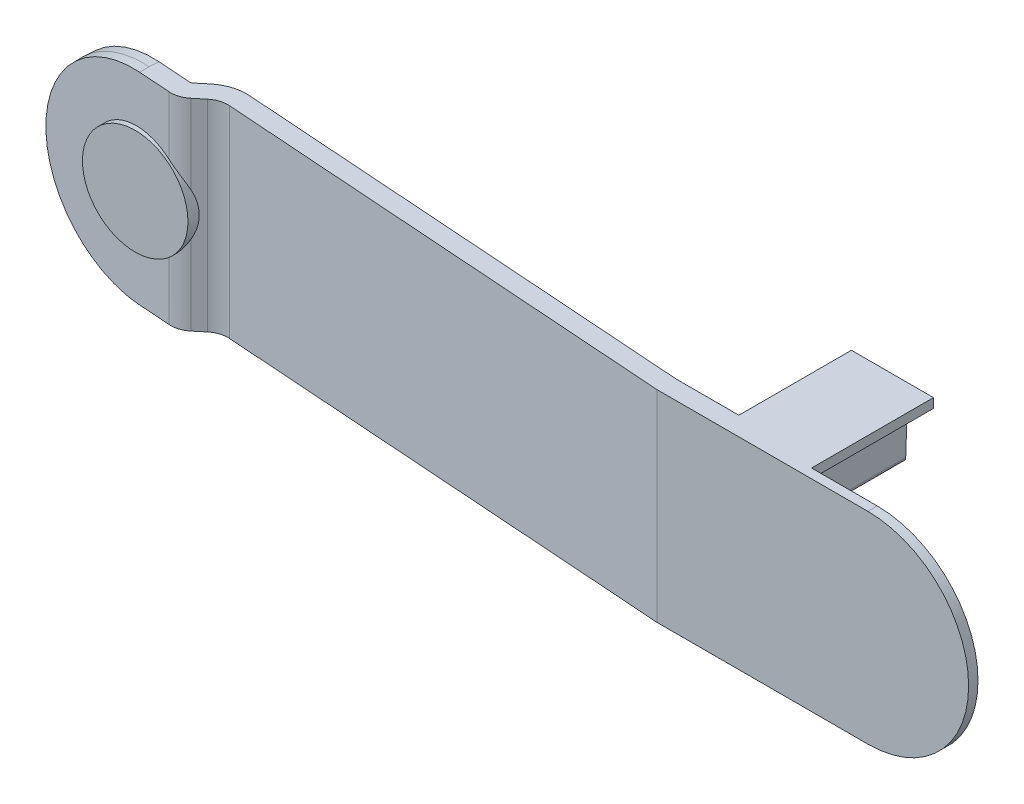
ISO-10303-21;
HEADER;
FILE_DESCRIPTION(('STEP AP214'),'2;1');
FILE_NAME('part.step','',(''),(''),'','','');
FILE_SCHEMA(('AUTOMOTIVE_DESIGN { 1 0 10303 214 1 1 1 1 }'));
ENDSEC;
DATA;
#1=APPLICATION_CONTEXT('core data for automotive mechanical design processes');
#2=APPLICATION_PROTOCOL_DEFINITION('international standard','automotive_design',2000,#1);
#3=PRODUCT_CONTEXT('',#1,'mechanical');
#4=PRODUCT('Part','Part','',(#3));
#5=PRODUCT_RELATED_PRODUCT_CATEGORY('part','',(#4));
#6=PRODUCT_DEFINITION_FORMATION('','',#4);
#7=PRODUCT_DEFINITION_CONTEXT('part definition',#1,'design');
#8=PRODUCT_DEFINITION('design','',#6,#7);
#9=PRODUCT_DEFINITION_SHAPE('','',#8);
#10=(LENGTH_UNIT() NAMED_UNIT(*) SI_UNIT(.MILLI.,.METRE.));
#11=(NAMED_UNIT(*) PLANE_ANGLE_UNIT() SI_UNIT($,.RADIAN.));
#12=(NAMED_UNIT(*) SI_UNIT($,.STERADIAN.) SOLID_ANGLE_UNIT());
#13=UNCERTAINTY_MEASURE_WITH_UNIT(LENGTH_MEASURE(1.E-05),#10,'distance_accuracy_value','');
#14=(GEOMETRIC_REPRESENTATION_CONTEXT(3) GLOBAL_UNCERTAINTY_ASSIGNED_CONTEXT((#13)) GLOBAL_UNIT_ASSIGNED_CONTEXT((#10,
#11,#12)) REPRESENTATION_CONTEXT('',''));
#15=CARTESIAN_POINT('',(0.,0.,0.));
#16=DIRECTION('',(0.,0.,1.));
#17=DIRECTION('',(1.,0.,0.));
#18=AXIS2_PLACEMENT_3D('',#15,#16,#17);
#19=CARTESIAN_POINT('',(0.,0.,108.));
#20=DIRECTION('',(0.,0.,-1.));
#21=DIRECTION('',(1.,0.,0.));
#22=AXIS2_PLACEMENT_3D('',#19,#20,#21);
#23=PLANE('',#22);
#24=CARTESIAN_POINT('',(-65.,-16.,108.));
#25=DIRECTION('',(0.,0.,1.));
#26=DIRECTION('',(1.,0.,0.));
#27=AXIS2_PLACEMENT_3D('',#24,#25,#26);
#28=CIRCLE('',#27,11.8520622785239);
#29=CARTESIAN_POINT('',(-53.1479377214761,-16.,108.));
#30=VERTEX_POINT('',#29);
#31=EDGE_CURVE('E943',#30,#30,#28,.F.);
#32=ORIENTED_EDGE('',*,*,#31,.F.);
#33=EDGE_LOOP('',(#32));
#34=FACE_BOUND('',#33,.T.);
#35=CARTESIAN_POINT('',(0.,0.,108.));
#36=DIRECTION('',(0.,0.,1.));
#37=DIRECTION('',(1.,0.,0.));
#38=AXIS2_PLACEMENT_3D('',#35,#36,#37);
#39=CIRCLE('',#38,22.);
#40=CARTESIAN_POINT('',(22.,0.,108.));
#41=VERTEX_POINT('',#40);
#42=EDGE_CURVE('E1057',#41,#41,#39,.F.);
#43=ORIENTED_EDGE('',*,*,#42,.F.);
#44=EDGE_LOOP('',(#43));
#45=FACE_BOUND('',#44,.T.);
#46=CARTESIAN_POINT('',(-60.9313775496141,37.,108.));
#47=DIRECTION('',(0.,0.,-1.));
#48=DIRECTION('',(1.,0.,0.));
#49=AXIS2_PLACEMENT_3D('',#46,#47,#48);
#50=CIRCLE('',#49,2.);
#51=CARTESIAN_POINT('',(-60.9313775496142,39.,108.));
#52=VERTEX_POINT('',#51);
#53=CARTESIAN_POINT('',(-58.9325958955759,37.069798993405,108.));
#54=VERTEX_POINT('',#53);
#55=EDGE_CURVE('E1149',#52,#54,#50,.T.);
#56=ORIENTED_EDGE('',*,*,#55,.T.);
#57=DIRECTION('',(0.0348994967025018,-0.999390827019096,0.));
#58=VECTOR('',#57,1.);
#59=CARTESIAN_POINT('',(-58.932595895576,37.069798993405,108.));
#60=LINE('',#59,#58);
#61=CARTESIAN_POINT('',(-58.1594640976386,14.930201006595,108.));
#62=VERTEX_POINT('',#61);
#63=EDGE_CURVE('E1147',#54,#62,#60,.T.);
#64=ORIENTED_EDGE('',*,*,#63,.T.);
#65=CARTESIAN_POINT('',(-56.1606824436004,15.,108.));
#66=DIRECTION('',(0.,0.,1.));
#67=DIRECTION('',(-1.,0.,0.));
#68=AXIS2_PLACEMENT_3D('',#65,#66,#67);
#69=CIRCLE('',#68,2.);
#70=CARTESIAN_POINT('',(-56.1606824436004,13.,108.));
#71=VERTEX_POINT('',#70);
#72=EDGE_CURVE('E1865',#62,#71,#69,.T.);
#73=ORIENTED_EDGE('',*,*,#72,.T.);
#74=DIRECTION('',(1.,0.,0.));
#75=VECTOR('',#74,1.);
#76=CARTESIAN_POINT('',(-56.1606824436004,13.,108.));
#77=LINE('',#76,#75);
#78=CARTESIAN_POINT('',(-41.8393175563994,13.,108.));
#79=VERTEX_POINT('',#78);
#80=EDGE_CURVE('E1138',#71,#79,#77,.T.);
#81=ORIENTED_EDGE('',*,*,#80,.T.);
#82=CARTESIAN_POINT('',(-41.8393175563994,15.,108.));
#83=DIRECTION('',(0.,0.,1.));
#84=DIRECTION('',(-1.,0.,0.));
#85=AXIS2_PLACEMENT_3D('',#82,#83,#84);
#86=CIRCLE('',#85,2.);
#87=CARTESIAN_POINT('',(-39.8405359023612,14.930201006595,108.));
#88=VERTEX_POINT('',#87);
#89=EDGE_CURVE('E1133',#79,#88,#86,.T.);
#90=ORIENTED_EDGE('',*,*,#89,.T.);
#91=DIRECTION('',(0.0348994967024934,0.999390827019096,0.));
#92=VECTOR('',#91,1.);
#93=CARTESIAN_POINT('',(-39.8405359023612,14.930201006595,108.));
#94=LINE('',#93,#92);
#95=CARTESIAN_POINT('',(-39.067404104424,37.069798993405,108.));
#96=VERTEX_POINT('',#95);
#97=EDGE_CURVE('E1871',#88,#96,#94,.T.);
#98=ORIENTED_EDGE('',*,*,#97,.T.);
#99=CARTESIAN_POINT('',(-37.0686224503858,37.,108.));
#100=DIRECTION('',(0.,0.,-1.));
#101=DIRECTION('',(-1.,0.,0.));
#102=AXIS2_PLACEMENT_3D('',#99,#100,#101);
#103=CIRCLE('',#102,2.);
#104=CARTESIAN_POINT('',(-37.0686224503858,39.,108.));
#105=VERTEX_POINT('',#104);
#106=EDGE_CURVE('E1121',#96,#105,#103,.T.);
#107=ORIENTED_EDGE('',*,*,#106,.T.);
#108=DIRECTION('',(1.,0.,0.));
#109=VECTOR('',#108,1.);
#110=CARTESIAN_POINT('',(-37.0686224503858,39.,108.));
#111=LINE('',#110,#109);
#112=CARTESIAN_POINT('',(-28.,39.,108.));
#113=VERTEX_POINT('',#112);
#114=EDGE_CURVE('E458',#105,#113,#111,.T.);
#115=ORIENTED_EDGE('',*,*,#114,.T.);
#116=DIRECTION('',(0.,1.,0.));
#117=VECTOR('',#116,1.);
#118=CARTESIAN_POINT('',(-28.,39.,108.));
#119=LINE('',#118,#117);
#120=CARTESIAN_POINT('',(-28.,43.,108.));
#121=VERTEX_POINT('',#120);
#122=EDGE_CURVE('E455',#113,#121,#119,.T.);
#123=ORIENTED_EDGE('',*,*,#122,.T.);
#124=DIRECTION('',(-1.,0.,0.));
#125=VECTOR('',#124,1.);
#126=CARTESIAN_POINT('',(0.,43.,108.));
#127=LINE('',#126,#125);
#128=CARTESIAN_POINT('',(0.,43.,108.));
#129=VERTEX_POINT('',#128);
#130=EDGE_CURVE('E1071',#129,#121,#127,.T.);
#131=ORIENTED_EDGE('',*,*,#130,.F.);
#132=CARTESIAN_POINT('',(0.,0.,108.));
#133=DIRECTION('',(0.,0.,1.));
#134=DIRECTION('',(1.,0.,0.));
#135=AXIS2_PLACEMENT_3D('',#132,#133,#134);
#136=CIRCLE('',#135,43.);
#137=CARTESIAN_POINT('',(0.,-43.,108.));
#138=VERTEX_POINT('',#137);
#139=EDGE_CURVE('E894',#138,#129,#136,.T.);
#140=ORIENTED_EDGE('',*,*,#139,.F.);
#141=DIRECTION('',(1.,0.,0.));
#142=VECTOR('',#141,1.);
#143=CARTESIAN_POINT('',(-90.,-43.,108.));
#144=LINE('',#143,#142);
#145=CARTESIAN_POINT('',(-87.7446628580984,-43.,108.));
#146=VERTEX_POINT('',#145);
#147=EDGE_CURVE('E1069',#146,#138,#144,.T.);
#148=ORIENTED_EDGE('',*,*,#147,.F.);
#149=DIRECTION('',(0.,-1.,0.));
#150=VECTOR('',#149,1.);
#151=CARTESIAN_POINT('',(-87.7446628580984,0.,108.));
#152=LINE('',#151,#150);
#153=CARTESIAN_POINT('',(-87.7446628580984,-39.,108.));
#154=VERTEX_POINT('',#153);
#155=EDGE_CURVE('E1829',#154,#146,#152,.T.);
#156=ORIENTED_EDGE('',*,*,#155,.F.);
#157=DIRECTION('',(1.,0.,0.));
#158=VECTOR('',#157,1.);
#159=CARTESIAN_POINT('',(0.,-39.,108.));
#160=LINE('',#159,#158);
#161=CARTESIAN_POINT('',(-89.7210307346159,-39.,108.));
#162=VERTEX_POINT('',#161);
#163=EDGE_CURVE('E1827',#162,#154,#160,.T.);
#164=ORIENTED_EDGE('',*,*,#163,.F.);
#165=DIRECTION('',(0.,1.,0.));
#166=VECTOR('',#165,1.);
#167=CARTESIAN_POINT('',(-89.721030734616,0.,108.));
#168=LINE('',#167,#166);
#169=CARTESIAN_POINT('',(-89.721030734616,39.,108.));
#170=VERTEX_POINT('',#169);
#171=EDGE_CURVE('E1169',#162,#170,#168,.T.);
#172=ORIENTED_EDGE('',*,*,#171,.T.);
#173=DIRECTION('',(-1.,0.,0.));
#174=VECTOR('',#173,1.);
#175=CARTESIAN_POINT('',(0.,39.,108.));
#176=LINE('',#175,#174);
#177=EDGE_CURVE('E1160',#52,#170,#176,.T.);
#178=ORIENTED_EDGE('',*,*,#177,.F.);
#179=EDGE_LOOP('',(#56,#64,#73,#81,#90,#98,#107,#115,#123,#131,#140,#148,#156,#164,#172,#178));
#180=FACE_BOUND('',#179,.T.);
#181=ADVANCED_FACE('F30',(#34,#45,#180),#23,.T.);
#182=DIRECTION('',(0.,-1.,0.));
#183=VECTOR('',#182,1.);
#184=CARTESIAN_POINT('',(-89.860316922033,0.,108.));
#185=LINE('',#184,#183);
#186=CARTESIAN_POINT('',(-89.860316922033,39.,108.));
#187=VERTEX_POINT('',#186);
#188=CARTESIAN_POINT('',(-89.8603169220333,-39.,108.));
#189=VERTEX_POINT('',#188);
#190=EDGE_CURVE('E1179',#187,#189,#185,.T.);
#191=ORIENTED_EDGE('',*,*,#190,.T.);
#192=DIRECTION('',(0.,-1.,0.));
#193=VECTOR('',#192,1.);
#194=CARTESIAN_POINT('',(-89.8603169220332,0.,108.));
#195=LINE('',#194,#193);
#196=CARTESIAN_POINT('',(-89.860316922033,-43.,108.));
#197=VERTEX_POINT('',#196);
#198=EDGE_CURVE('E1823',#189,#197,#195,.T.);
#199=ORIENTED_EDGE('',*,*,#198,.T.);
#200=CARTESIAN_POINT('',(-90.,-43.,108.));
#201=VERTEX_POINT('',#200);
#202=EDGE_CURVE('E1066',#201,#197,#144,.T.);
#203=ORIENTED_EDGE('',*,*,#202,.F.);
#204=DIRECTION('',(0.,-1.,0.));
#205=VECTOR('',#204,1.);
#206=CARTESIAN_POINT('',(-90.,43.,108.));
#207=LINE('',#206,#205);
#208=CARTESIAN_POINT('',(-90.0000000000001,39.,108.));
#209=VERTEX_POINT('',#208);
#210=EDGE_CURVE('E34',#209,#201,#207,.T.);
#211=ORIENTED_EDGE('',*,*,#210,.F.);
#212=DIRECTION('',(1.,0.,0.));
#213=VECTOR('',#212,1.);
#214=CARTESIAN_POINT('',(-63.,39.,108.));
#215=LINE('',#214,#213);
#216=EDGE_CURVE('E448',#209,#187,#215,.T.);
#217=ORIENTED_EDGE('',*,*,#216,.T.);
#218=EDGE_LOOP('',(#191,#199,#203,#211,#217));
#219=FACE_BOUND('',#218,.T.);
#220=ADVANCED_FACE('F844',(#219),#23,.T.);
#221=CARTESIAN_POINT('',(-90.,0.,60.));
#222=DIRECTION('',(1.,0.,0.));
#223=DIRECTION('',(0.,0.,1.));
#224=AXIS2_PLACEMENT_3D('',#221,#222,#223);
#225=PLANE('',#224);
#226=ORIENTED_EDGE('',*,*,#210,.T.);
#227=DIRECTION('',(0.,0.,1.));
#228=VECTOR('',#227,1.);
#229=CARTESIAN_POINT('',(-90.,-43.,60.));
#230=LINE('',#229,#228);
#231=CARTESIAN_POINT('',(-90.,-43.,107.990232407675));
#232=VERTEX_POINT('',#231);
#233=EDGE_CURVE('E906',#232,#201,#230,.T.);
#234=ORIENTED_EDGE('',*,*,#233,.F.);
#235=DIRECTION('',(0.,1.,0.));
#236=VECTOR('',#235,1.);
#237=CARTESIAN_POINT('',(-90.,0.,107.990232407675));
#238=LINE('',#237,#236);
#239=CARTESIAN_POINT('',(-90.,-39.,107.990232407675));
#240=VERTEX_POINT('',#239);
#241=EDGE_CURVE('E911',#232,#240,#238,.T.);
#242=ORIENTED_EDGE('',*,*,#241,.T.);
#243=CARTESIAN_POINT('',(-90.0000000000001,39.,107.990232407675));
#244=VERTEX_POINT('',#243);
#245=EDGE_CURVE('E905',#240,#244,#238,.T.);
#246=ORIENTED_EDGE('',*,*,#245,.T.);
#247=DIRECTION('',(0.,0.,1.));
#248=VECTOR('',#247,1.);
#249=CARTESIAN_POINT('',(-90.0000000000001,39.,104.));
#250=LINE('',#249,#248);
#251=EDGE_CURVE('E514',#244,#209,#250,.T.);
#252=ORIENTED_EDGE('',*,*,#251,.T.);
#253=EDGE_LOOP('',(#226,#234,#242,#246,#252));
#254=FACE_BOUND('',#253,.T.);
#255=ADVANCED_FACE('F691',(#254),#225,.T.);
#256=CARTESIAN_POINT('',(-87.4759316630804,39.,104.156964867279));
#257=DIRECTION('',(0.0697564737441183,0.,-0.997564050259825));
#258=DIRECTION('',(0.997564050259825,0.,0.0697564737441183));
#259=AXIS2_PLACEMENT_3D('',#256,#257,#258);
#260=PLANE('',#259);
#261=DIRECTION('',(0.997564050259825,0.,0.0697564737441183));
#262=VECTOR('',#261,1.);
#263=CARTESIAN_POINT('',(-268.831135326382,39.,91.4753736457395));
#264=LINE('',#263,#262);
#265=CARTESIAN_POINT('',(-285.440284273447,38.9999999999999,90.3139488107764));
#266=VERTEX_POINT('',#265);
#267=CARTESIAN_POINT('',(-89.7206338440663,39.,104.));
#268=VERTEX_POINT('',#267);
#269=EDGE_CURVE('E1152',#266,#268,#264,.T.);
#270=ORIENTED_EDGE('',*,*,#269,.F.);
#271=DIRECTION('',(0.,1.,0.));
#272=VECTOR('',#271,1.);
#273=CARTESIAN_POINT('',(-285.440284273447,38.9999999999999,90.3139488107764));
#274=LINE('',#273,#272);
#275=CARTESIAN_POINT('',(-285.440284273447,42.9999999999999,90.3139488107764));
#276=VERTEX_POINT('',#275);
#277=EDGE_CURVE('E607',#266,#276,#274,.T.);
#278=ORIENTED_EDGE('',*,*,#277,.T.);
#279=DIRECTION('',(-0.997564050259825,0.,-0.0697564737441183));
#280=VECTOR('',#279,1.);
#281=CARTESIAN_POINT('',(-268.831135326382,43.,91.4753736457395));
#282=LINE('',#281,#280);
#283=CARTESIAN_POINT('',(-89.7206338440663,43.,104.));
#284=VERTEX_POINT('',#283);
#285=EDGE_CURVE('E1093',#284,#276,#282,.T.);
#286=ORIENTED_EDGE('',*,*,#285,.F.);
#287=DIRECTION('',(0.,1.,0.));
#288=VECTOR('',#287,1.);
#289=CARTESIAN_POINT('',(-89.7206338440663,39.,104.));
#290=LINE('',#289,#288);
#291=EDGE_CURVE('E11',#268,#284,#290,.T.);
#292=ORIENTED_EDGE('',*,*,#291,.F.);
#293=EDGE_LOOP('',(#270,#278,#286,#292));
#294=FACE_BOUND('',#293,.T.);
#295=ADVANCED_FACE('F687',(#294),#260,.T.);
#296=CARTESIAN_POINT('',(-89.7209741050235,-43.0002650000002,108.009743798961));
#297=DIRECTION('',(-0.0697564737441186,0.,0.997564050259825));
#298=DIRECTION('',(-0.997564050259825,0.,-0.0697564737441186));
#299=AXIS2_PLACEMENT_3D('',#296,#297,#298);
#300=PLANE('',#299);
#301=DIRECTION('',(0.997564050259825,0.,0.0697564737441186));
#302=VECTOR('',#301,1.);
#303=CARTESIAN_POINT('',(-258.5,-21.5,96.2075645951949));
#304=LINE('',#303,#302);
#305=CARTESIAN_POINT('',(-239.639512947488,-21.5,97.5264183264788));
#306=VERTEX_POINT('',#305);
#307=CARTESIAN_POINT('',(-260.639512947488,-21.5,96.0579552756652));
#308=VERTEX_POINT('',#307);
#309=EDGE_CURVE('E777',#306,#308,#304,.F.);
#310=ORIENTED_EDGE('',*,*,#309,.F.);
#311=DIRECTION('',(0.,1.,0.));
#312=VECTOR('',#311,1.);
#313=CARTESIAN_POINT('',(-239.639512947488,-19.5,97.5264183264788));
#314=LINE('',#313,#312);
#315=CARTESIAN_POINT('',(-239.639512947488,-2.50000000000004,97.5264183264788));
#316=VERTEX_POINT('',#315);
#317=EDGE_CURVE('E774',#316,#306,#314,.F.);
#318=ORIENTED_EDGE('',*,*,#317,.F.);
#319=DIRECTION('',(-0.997564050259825,0.,-0.0697564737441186));
#320=VECTOR('',#319,1.);
#321=CARTESIAN_POINT('',(-241.5,-2.50000000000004,97.3963203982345));
#322=LINE('',#321,#320);
#323=CARTESIAN_POINT('',(-260.639512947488,-2.50000000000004,96.0579552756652));
#324=VERTEX_POINT('',#323);
#325=EDGE_CURVE('E771',#324,#316,#322,.F.);
#326=ORIENTED_EDGE('',*,*,#325,.F.);
#327=DIRECTION('',(0.,-1.,0.));
#328=VECTOR('',#327,1.);
#329=CARTESIAN_POINT('',(-260.639512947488,-4.50000000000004,96.0579552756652));
#330=LINE('',#329,#328);
#331=EDGE_CURVE('E780',#308,#324,#330,.F.);
#332=ORIENTED_EDGE('',*,*,#331,.F.);
#333=EDGE_LOOP('',(#310,#318,#326,#332));
#334=FACE_BOUND('',#333,.T.);
#335=DIRECTION('',(0.997564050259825,0.,0.0697564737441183));
#336=VECTOR('',#335,1.);
#337=CARTESIAN_POINT('',(-269.110161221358,39.,95.4656298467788));
#338=LINE('',#337,#336);
#339=CARTESIAN_POINT('',(-285.719310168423,38.9999999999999,94.3042050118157));
#340=VERTEX_POINT('',#339);
#341=EDGE_CURVE('E1090',#340,#244,#338,.T.);
#342=ORIENTED_EDGE('',*,*,#341,.T.);
#343=ORIENTED_EDGE('',*,*,#245,.F.);
#344=DIRECTION('',(-0.997564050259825,0.,-0.0697564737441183));
#345=VECTOR('',#344,1.);
#346=CARTESIAN_POINT('',(-269.110161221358,-39.,95.4656298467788));
#347=LINE('',#346,#345);
#348=CARTESIAN_POINT('',(-285.719310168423,-38.9999999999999,94.3042050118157));
#349=VERTEX_POINT('',#348);
#350=EDGE_CURVE('E1088',#240,#349,#347,.T.);
#351=ORIENTED_EDGE('',*,*,#350,.T.);
#352=DIRECTION('',(0.,1.,0.));
#353=VECTOR('',#352,1.);
#354=CARTESIAN_POINT('',(-285.719310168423,-43.0002650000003,94.3042050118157));
#355=LINE('',#354,#353);
#356=EDGE_CURVE('E1092',#349,#340,#355,.T.);
#357=ORIENTED_EDGE('',*,*,#356,.T.);
#358=EDGE_LOOP('',(#342,#343,#351,#357));
#359=FACE_BOUND('',#358,.T.);
#360=DIRECTION('',(0.997564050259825,0.,0.0697564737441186));
#361=VECTOR('',#360,1.);
#362=CARTESIAN_POINT('',(-180.,-23.5,101.69681933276));
#363=LINE('',#362,#361);
#364=CARTESIAN_POINT('',(-136.279025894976,-23.5,104.754087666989));
#365=VERTEX_POINT('',#364);
#366=CARTESIAN_POINT('',(-184.279025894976,-23.5,101.397600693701));
#367=VERTEX_POINT('',#366);
#368=EDGE_CURVE('E743',#365,#367,#363,.F.);
#369=ORIENTED_EDGE('',*,*,#368,.F.);
#370=DIRECTION('',(0.,1.,0.));
#371=VECTOR('',#370,1.);
#372=CARTESIAN_POINT('',(-136.279025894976,-19.5,104.754087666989));
#373=LINE('',#372,#371);
#374=CARTESIAN_POINT('',(-136.279025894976,14.5,104.754087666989));
#375=VERTEX_POINT('',#374);
#376=EDGE_CURVE('E736',#375,#365,#373,.F.);
#377=ORIENTED_EDGE('',*,*,#376,.F.);
#378=DIRECTION('',(-0.997564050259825,0.,-0.0697564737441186));
#379=VECTOR('',#378,1.);
#380=CARTESIAN_POINT('',(-140.,14.5,104.4938918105));
#381=LINE('',#380,#379);
#382=CARTESIAN_POINT('',(-184.279025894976,14.5,101.397600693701));
#383=VERTEX_POINT('',#382);
#384=EDGE_CURVE('E740',#383,#375,#381,.F.);
#385=ORIENTED_EDGE('',*,*,#384,.F.);
#386=DIRECTION('',(0.,-1.,0.));
#387=VECTOR('',#386,1.);
#388=CARTESIAN_POINT('',(-184.279025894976,10.5,101.397600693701));
#389=LINE('',#388,#387);
#390=EDGE_CURVE('E746',#367,#383,#389,.F.);
#391=ORIENTED_EDGE('',*,*,#390,.F.);
#392=EDGE_LOOP('',(#369,#377,#385,#391));
#393=FACE_BOUND('',#392,.T.);
#394=ADVANCED_FACE('F690',(#334,#359,#393),#300,.F.);
#395=CARTESIAN_POINT('',(-285.9983360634,-43.0000500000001,98.2944612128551));
#396=DIRECTION('',(0.0697564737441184,0.,-0.997564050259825));
#397=DIRECTION('',(0.997564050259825,0.,0.0697564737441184));
#398=AXIS2_PLACEMENT_3D('',#395,#396,#397);
#399=PLANE('',#398);
#400=DIRECTION('',(0.,1.,0.));
#401=VECTOR('',#400,1.);
#402=CARTESIAN_POINT('',(-90.,-43.00005,112.));
#403=LINE('',#402,#401);
#404=CARTESIAN_POINT('',(-90.,-43.0000025,112.));
#405=VERTEX_POINT('',#404);
#406=CARTESIAN_POINT('',(-90.,43.,112.));
#407=VERTEX_POINT('',#406);
#408=EDGE_CURVE('E983',#405,#407,#403,.T.);
#409=ORIENTED_EDGE('',*,*,#408,.T.);
#410=DIRECTION('',(0.997564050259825,0.,0.0697564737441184));
#411=VECTOR('',#410,1.);
#412=CARTESIAN_POINT('',(-285.9983360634,42.9999999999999,98.2944612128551));
#413=LINE('',#412,#411);
#414=CARTESIAN_POINT('',(-285.9983360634,42.9999999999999,98.294461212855));
#415=VERTEX_POINT('',#414);
#416=EDGE_CURVE('E969',#415,#407,#413,.T.);
#417=ORIENTED_EDGE('',*,*,#416,.F.);
#418=DIRECTION('',(0.,1.,0.));
#419=VECTOR('',#418,1.);
#420=CARTESIAN_POINT('',(-285.9983360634,-43.0000500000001,98.294461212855));
#421=LINE('',#420,#419);
#422=CARTESIAN_POINT('',(-285.9983360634,-42.9999999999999,98.294461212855));
#423=VERTEX_POINT('',#422);
#424=EDGE_CURVE('E939',#423,#415,#421,.T.);
#425=ORIENTED_EDGE('',*,*,#424,.F.);
#426=DIRECTION('',(0.997564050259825,0.,0.0697564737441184));
#427=VECTOR('',#426,1.);
#428=CARTESIAN_POINT('',(-90.2783462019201,-43.,111.980536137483));
#429=LINE('',#428,#427);
#430=EDGE_CURVE('E917',#423,#405,#429,.T.);
#431=ORIENTED_EDGE('',*,*,#430,.T.);
#432=EDGE_LOOP('',(#409,#417,#425,#431));
#433=FACE_BOUND('',#432,.T.);
#434=ADVANCED_FACE('F701',(#433),#399,.F.);
#435=CARTESIAN_POINT('',(-317.220974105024,-43.0002650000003,101.107464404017));
#436=DIRECTION('',(-0.0697564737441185,0.,0.997564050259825));
#437=DIRECTION('',(-0.997564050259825,0.,-0.0697564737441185));
#438=AXIS2_PLACEMENT_3D('',#435,#436,#437);
#439=PLANE('',#438);
#440=DIRECTION('',(-0.997564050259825,0.,-0.0697564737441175));
#441=VECTOR('',#440,1.);
#442=CARTESIAN_POINT('',(-303.722638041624,38.9999999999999,102.051360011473));
#443=LINE('',#442,#441);
#444=CARTESIAN_POINT('',(-303.722638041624,38.9999999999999,102.051360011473));
#445=VERTEX_POINT('',#444);
#446=CARTESIAN_POINT('',(-317.5,38.9999999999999,101.087953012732));
#447=VERTEX_POINT('',#446);
#448=EDGE_CURVE('E590',#445,#447,#443,.T.);
#449=ORIENTED_EDGE('',*,*,#448,.F.);
#450=DIRECTION('',(0.,1.,0.));
#451=VECTOR('',#450,1.);
#452=CARTESIAN_POINT('',(-303.722638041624,-43.0002650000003,102.051360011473));
#453=LINE('',#452,#451);
#454=CARTESIAN_POINT('',(-303.722638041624,-38.9999999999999,102.051360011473));
#455=VERTEX_POINT('',#454);
#456=EDGE_CURVE('E1166',#455,#445,#453,.T.);
#457=ORIENTED_EDGE('',*,*,#456,.F.);
#458=DIRECTION('',(0.997564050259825,0.,0.0697564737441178));
#459=VECTOR('',#458,1.);
#460=CARTESIAN_POINT('',(-303.722638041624,-38.9999999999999,102.051360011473));
#461=LINE('',#460,#459);
#462=CARTESIAN_POINT('',(-317.5,-38.9999999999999,101.087953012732));
#463=VERTEX_POINT('',#462);
#464=EDGE_CURVE('E627',#463,#455,#461,.T.);
#465=ORIENTED_EDGE('',*,*,#464,.F.);
#466=CARTESIAN_POINT('',(-317.499999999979,39.,101.087953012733));
#467=CARTESIAN_POINT('',(-320.073370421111,39.0000000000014,100.908005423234));
#468=CARTESIAN_POINT('',(-322.603938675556,38.7479199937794,100.731050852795));
#469=CARTESIAN_POINT('',(-326.338195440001,38.0070374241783,100.469926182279));
#470=CARTESIAN_POINT('',(-327.5726056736,37.6991680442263,100.383607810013));
#471=CARTESIAN_POINT('',(-330.020269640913,36.958829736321,100.21245047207));
#472=CARTESIAN_POINT('',(-331.237167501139,36.5241702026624,100.127356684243));
#473=CARTESIAN_POINT('',(-334.777775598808,35.0592347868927,99.8797732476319));
#474=CARTESIAN_POINT('',(-337.01718472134,33.8637622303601,99.723178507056));
#475=CARTESIAN_POINT('',(-339.666510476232,32.098229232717,99.5379196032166));
#476=CARTESIAN_POINT('',(-340.188811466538,31.7314411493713,99.5013967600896));
#477=CARTESIAN_POINT('',(-341.218042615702,30.9700633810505,99.4294259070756));
#478=CARTESIAN_POINT('',(-341.72615575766,30.5744912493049,99.3938951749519));
#479=CARTESIAN_POINT('',(-343.21823158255,29.3522671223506,99.2895590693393));
#480=CARTESIAN_POINT('',(-344.165016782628,28.494737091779,99.2233533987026));
#481=CARTESIAN_POINT('',(-346.866071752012,25.7980111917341,99.0344772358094));
#482=CARTESIAN_POINT('',(-348.482359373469,23.8358544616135,98.9214553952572));
#483=CARTESIAN_POINT('',(-350.26671471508,21.1728467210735,98.796681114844));
#484=CARTESIAN_POINT('',(-350.612590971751,20.6280647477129,98.772495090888));
#485=CARTESIAN_POINT('',(-351.274640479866,19.5257913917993,98.7262000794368));
#486=CARTESIAN_POINT('',(-351.590795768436,18.9685549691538,98.704092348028));
#487=CARTESIAN_POINT('',(-352.495486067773,17.2788881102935,98.6408302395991));
#488=CARTESIAN_POINT('',(-353.585212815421,14.9781973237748,98.5646291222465));
#489=CARTESIAN_POINT('',(-354.445498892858,12.5833855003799,98.504472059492));
#490=CARTESIAN_POINT('',(-355.003531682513,10.7515129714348,98.4654506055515));
#491=CARTESIAN_POINT('',(-355.174986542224,10.1349176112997,98.4534613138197));
#492=CARTESIAN_POINT('',(-355.488268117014,8.88957284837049,98.431554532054));
#493=CARTESIAN_POINT('',(-355.630364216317,8.25920762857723,98.4216182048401));
#494=CARTESIAN_POINT('',(-356.25908244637,5.10802467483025,98.3776539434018));
#495=CARTESIAN_POINT('',(-356.507909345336,2.57422619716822,98.3602542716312));
#496=CARTESIAN_POINT('',(-356.510646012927,-1.24520769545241,98.3600629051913));
#497=CARTESIAN_POINT('',(-356.449360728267,-2.5214976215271,98.3643483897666));
#498=CARTESIAN_POINT('',(-356.261360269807,-4.4407908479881,98.3774946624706));
#499=CARTESIAN_POINT('',(-356.182444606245,-5.0821321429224,98.3830129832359));
#500=CARTESIAN_POINT('',(-355.994161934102,-6.35230803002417,98.3961789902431));
#501=CARTESIAN_POINT('',(-355.884673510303,-6.98285348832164,98.403835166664));
#502=CARTESIAN_POINT('',(-355.261806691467,-10.1132563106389,98.4473902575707));
#503=CARTESIAN_POINT('',(-354.524308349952,-12.5467778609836,98.4989611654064));
#504=CARTESIAN_POINT('',(-353.302284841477,-15.4998401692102,98.5844133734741));
#505=CARTESIAN_POINT('',(-353.042737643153,-16.0859707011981,98.6025626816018));
#506=CARTESIAN_POINT('',(-352.492770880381,-17.2490940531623,98.6410201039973));
#507=CARTESIAN_POINT('',(-352.202622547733,-17.8252699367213,98.6613092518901));
#508=CARTESIAN_POINT('',(-351.295577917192,-19.521086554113,98.7247359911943));
#509=CARTESIAN_POINT('',(-350.639278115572,-20.6143846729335,98.7706289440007));
#510=CARTESIAN_POINT('',(-348.519415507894,-23.7853167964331,98.9188641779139));
#511=CARTESIAN_POINT('',(-346.906358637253,-25.7550489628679,99.0316601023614));
#512=CARTESIAN_POINT('',(-344.175872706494,-28.4852453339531,99.222594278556));
#513=CARTESIAN_POINT('',(-343.225322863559,-29.3455140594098,99.2890631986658));
#514=CARTESIAN_POINT('',(-341.256019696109,-30.9605280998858,99.4267702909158));
#515=CARTESIAN_POINT('',(-340.2356710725,-31.7168585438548,99.4981200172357));
#516=CARTESIAN_POINT('',(-338.124188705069,-33.1280393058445,99.6457692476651));
#517=CARTESIAN_POINT('',(-337.033056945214,-33.7828924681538,99.7220686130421));
#518=CARTESIAN_POINT('',(-334.77856738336,-34.9890529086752,99.8797178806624));
#519=CARTESIAN_POINT('',(-333.610188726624,-35.5418563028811,99.9614188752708));
#520=CARTESIAN_POINT('',(-330.068334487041,-37.0087114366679,100.209089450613));
#521=CARTESIAN_POINT('',(-327.639542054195,-37.7453815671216,100.378927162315));
#522=CARTESIAN_POINT('',(-323.896322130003,-38.4931901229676,100.640678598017));
#523=CARTESIAN_POINT('',(-322.630051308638,-38.6826759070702,100.729224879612));
#524=CARTESIAN_POINT('',(-320.070033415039,-38.9365116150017,100.90823876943));
#525=CARTESIAN_POINT('',(-318.786686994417,-39.0000000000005,100.997979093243));
#526=CARTESIAN_POINT('',(-317.499999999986,-39.,101.087953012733));
#527=B_SPLINE_CURVE_WITH_KNOTS('',3,(#466,#467,#468,#469,#470,#471,#472,#473,#474,#475,#476,
#477,#478,#479,#480,#481,#482,#483,#484,#485,#486,#487,#488,#489,#490,#491,#492,#493,#494,#495,
#496,#497,#498,#499,#500,#501,#502,#503,#504,#505,#506,#507,#508,#509,#510,#511,#512,#513,#514,
#515,#516,#517,#518,#519,#520,#521,#522,#523,#524,#525,#526),.UNSPECIFIED.,.F.,.F.,(4,2,2,2,2,2,
2,2,2,2,2,1,2,2,2,2,2,2,2,2,2,2,2,2,2,2,2,2,2,2,4),(-1.67532654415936E-13,0.0624999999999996,
0.0937499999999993,0.124999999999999,0.187499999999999,0.203124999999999,0.21875,0.25,
0.312499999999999,0.328124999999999,0.343749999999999,0.374999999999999,0.406249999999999,
0.421874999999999,0.437499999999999,0.499999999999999,0.531249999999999,0.546874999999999,
0.562499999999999,0.624999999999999,0.640624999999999,0.656249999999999,0.6875,
0.750000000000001,0.781250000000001,0.812500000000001,0.843750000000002,0.875000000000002,
0.937500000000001,0.96875,1.00000000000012),.UNSPECIFIED.);
#528=EDGE_CURVE('E646',#463,#447,#527,.F.);
#529=ORIENTED_EDGE('',*,*,#528,.T.);
#530=EDGE_LOOP('',(#449,#457,#465,#529));
#531=FACE_BOUND('',#530,.T.);
#532=ADVANCED_FACE('F696',(#531),#439,.F.);
#533=CARTESIAN_POINT('',(-286.695900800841,-43.0002650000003,108.270101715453));
#534=DIRECTION('',(0.,1.,0.));
#535=DIRECTION('',(-1.,0.,0.));
#536=AXIS2_PLACEMENT_3D('',#533,#534,#535);
#537=CYLINDRICAL_SURFACE('',#536,14.);
#538=CARTESIAN_POINT('',(-286.695900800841,38.9999999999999,108.270101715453));
#539=DIRECTION('',(0.,1.,0.));
#540=DIRECTION('',(-1.,0.,0.));
#541=AXIS2_PLACEMENT_3D('',#538,#539,#540);
#542=CIRCLE('',#541,14.);
#543=CARTESIAN_POINT('',(-295.641609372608,38.9999999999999,97.5009653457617));
#544=VERTEX_POINT('',#543);
#545=EDGE_CURVE('E600',#340,#544,#542,.T.);
#546=ORIENTED_EDGE('',*,*,#545,.F.);
#547=ORIENTED_EDGE('',*,*,#356,.F.);
#548=CARTESIAN_POINT('',(-286.695900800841,-38.9999999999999,108.270101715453));
#549=DIRECTION('',(0.,-1.,0.));
#550=DIRECTION('',(1.,0.,0.));
#551=AXIS2_PLACEMENT_3D('',#548,#549,#550);
#552=CIRCLE('',#551,14.);
#553=CARTESIAN_POINT('',(-295.641609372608,-38.9999999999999,97.5009653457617));
#554=VERTEX_POINT('',#553);
#555=EDGE_CURVE('E632',#554,#349,#552,.T.);
#556=ORIENTED_EDGE('',*,*,#555,.F.);
#557=DIRECTION('',(0.,1.,0.));
#558=VECTOR('',#557,1.);
#559=CARTESIAN_POINT('',(-295.641609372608,-43.0002650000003,97.5009653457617));
#560=LINE('',#559,#558);
#561=EDGE_CURVE('E1173',#554,#544,#560,.T.);
#562=ORIENTED_EDGE('',*,*,#561,.T.);
#563=EDGE_LOOP('',(#546,#547,#556,#562));
#564=FACE_BOUND('',#563,.T.);
#565=ADVANCED_FACE('F700',(#564),#537,.T.);
#566=CARTESIAN_POINT('',(-295.641609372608,-43.0002650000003,97.5009653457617));
#567=DIRECTION('',(0.638979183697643,0.,0.769224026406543));
#568=DIRECTION('',(-0.769224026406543,0.,0.638979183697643));
#569=AXIS2_PLACEMENT_3D('',#566,#567,#568);
#570=PLANE('',#569);
#571=DIRECTION('',(-0.769224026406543,0.,0.638979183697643));
#572=VECTOR('',#571,1.);
#573=CARTESIAN_POINT('',(-295.641609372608,38.9999999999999,97.5009653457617));
#574=LINE('',#573,#572);
#575=CARTESIAN_POINT('',(-299.470224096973,38.9999999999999,100.681319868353));
#576=VERTEX_POINT('',#575);
#577=EDGE_CURVE('E603',#544,#576,#574,.T.);
#578=ORIENTED_EDGE('',*,*,#577,.F.);
#579=ORIENTED_EDGE('',*,*,#561,.F.);
#580=DIRECTION('',(0.769224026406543,0.,-0.638979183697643));
#581=VECTOR('',#580,1.);
#582=CARTESIAN_POINT('',(-295.641609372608,-38.9999999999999,97.5009653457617));
#583=LINE('',#582,#581);
#584=CARTESIAN_POINT('',(-299.470224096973,-38.9999999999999,100.681319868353));
#585=VERTEX_POINT('',#584);
#586=EDGE_CURVE('E630',#585,#554,#583,.T.);
#587=ORIENTED_EDGE('',*,*,#586,.F.);
#588=DIRECTION('',(0.,1.,0.));
#589=VECTOR('',#588,1.);
#590=CARTESIAN_POINT('',(-299.470224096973,-43.0002650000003,100.681319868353));
#591=LINE('',#590,#589);
#592=EDGE_CURVE('E1170',#585,#576,#591,.T.);
#593=ORIENTED_EDGE('',*,*,#592,.T.);
#594=EDGE_LOOP('',(#578,#579,#587,#593));
#595=FACE_BOUND('',#594,.T.);
#596=ADVANCED_FACE('F1709',(#595),#570,.F.);
#597=CARTESIAN_POINT('',(-303.304099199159,-43.0002650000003,96.0659757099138));
#598=DIRECTION('',(0.,1.,0.));
#599=DIRECTION('',(-1.,0.,0.));
#600=AXIS2_PLACEMENT_3D('',#597,#598,#599);
#601=CYLINDRICAL_SURFACE('',#600,5.99999999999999);
#602=CARTESIAN_POINT('',(-303.304099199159,38.9999999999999,96.0659757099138));
#603=DIRECTION('',(0.,-1.,0.));
#604=DIRECTION('',(-1.,0.,0.));
#605=AXIS2_PLACEMENT_3D('',#602,#603,#604);
#606=CIRCLE('',#605,5.99999999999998);
#607=EDGE_CURVE('E588',#576,#445,#606,.T.);
#608=ORIENTED_EDGE('',*,*,#607,.F.);
#609=ORIENTED_EDGE('',*,*,#592,.F.);
#610=CARTESIAN_POINT('',(-303.304099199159,-38.9999999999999,96.0659757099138));
#611=DIRECTION('',(0.,1.,0.));
#612=DIRECTION('',(1.,0.,0.));
#613=AXIS2_PLACEMENT_3D('',#610,#611,#612);
#614=CIRCLE('',#613,5.99999999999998);
#615=EDGE_CURVE('E628',#455,#585,#614,.T.);
#616=ORIENTED_EDGE('',*,*,#615,.F.);
#617=ORIENTED_EDGE('',*,*,#456,.T.);
#618=EDGE_LOOP('',(#608,#609,#616,#617));
#619=FACE_BOUND('',#618,.T.);
#620=ADVANCED_FACE('F703',(#619),#601,.F.);
#621=CARTESIAN_POINT('',(-89.7209741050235,-39.,108.009743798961));
#622=VERTEX_POINT('',#621);
#623=EDGE_CURVE('E1834',#622,#189,#347,.T.);
#624=ORIENTED_EDGE('',*,*,#623,.T.);
#625=ORIENTED_EDGE('',*,*,#190,.F.);
#626=CARTESIAN_POINT('',(-89.7209741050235,39.,108.009743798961));
#627=VERTEX_POINT('',#626);
#628=EDGE_CURVE('E1094',#187,#627,#338,.T.);
#629=ORIENTED_EDGE('',*,*,#628,.T.);
#630=DIRECTION('',(0.,1.,0.));
#631=VECTOR('',#630,1.);
#632=CARTESIAN_POINT('',(-89.7209741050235,-43.0002650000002,108.009743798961));
#633=LINE('',#632,#631);
#634=EDGE_CURVE('E1165',#622,#627,#633,.T.);
#635=ORIENTED_EDGE('',*,*,#634,.F.);
#636=EDGE_LOOP('',(#624,#625,#629,#635));
#637=FACE_BOUND('',#636,.T.);
#638=ADVANCED_FACE('F1691',(#637),#300,.F.);
#639=CARTESIAN_POINT('',(-89.7209741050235,-43.0002650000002,108.009743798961));
#640=DIRECTION('',(0.999983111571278,0.,-0.00581176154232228));
#641=DIRECTION('',(0.00581176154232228,0.,0.999983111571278));
#642=AXIS2_PLACEMENT_3D('',#639,#640,#641);
#643=PLANE('',#642);
#644=DIRECTION('',(0.00581176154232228,0.,0.999983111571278));
#645=VECTOR('',#644,1.);
#646=CARTESIAN_POINT('',(-89.7209741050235,-39.,108.009743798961));
#647=LINE('',#646,#645);
#648=EDGE_CURVE('E1825',#162,#622,#647,.T.);
#649=ORIENTED_EDGE('',*,*,#648,.T.);
#650=ORIENTED_EDGE('',*,*,#634,.T.);
#651=DIRECTION('',(-0.00581176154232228,0.,-0.999983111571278));
#652=VECTOR('',#651,1.);
#653=CARTESIAN_POINT('',(-89.7209741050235,39.,108.009743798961));
#654=LINE('',#653,#652);
#655=EDGE_CURVE('E737',#627,#170,#654,.T.);
#656=ORIENTED_EDGE('',*,*,#655,.T.);
#657=ORIENTED_EDGE('',*,*,#171,.F.);
#658=EDGE_LOOP('',(#649,#650,#656,#657));
#659=FACE_BOUND('',#658,.T.);
#660=ADVANCED_FACE('F1683',(#659),#643,.F.);
#661=CARTESIAN_POINT('',(-296.914307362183,-43.0000500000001,103.758215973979));
#662=DIRECTION('',(-0.638979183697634,0.,-0.769224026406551));
#663=DIRECTION('',(0.769224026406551,0.,-0.638979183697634));
#664=AXIS2_PLACEMENT_3D('',#661,#662,#663);
#665=PLANE('',#664);
#666=CARTESIAN_POINT('',(-317.5,0.,120.858343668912));
#667=DIRECTION('',(0.638979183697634,0.,0.769224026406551));
#668=DIRECTION('',(-0.769224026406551,0.,0.638979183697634));
#669=AXIS2_PLACEMENT_3D('',#666,#667,#668);
#670=ELLIPSE('',#669,29.2502563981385,22.5);
#671=CARTESIAN_POINT('',(-296.914307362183,9.0818092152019,103.758215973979));
#672=VERTEX_POINT('',#671);
#673=CARTESIAN_POINT('',(-296.914307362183,-9.08180921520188,103.758215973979));
#674=VERTEX_POINT('',#673);
#675=EDGE_CURVE('E994',#672,#674,#670,.F.);
#676=ORIENTED_EDGE('',*,*,#675,.T.);
#677=DIRECTION('',(0.,1.,0.));
#678=VECTOR('',#677,1.);
#679=CARTESIAN_POINT('',(-296.914307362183,-43.0000500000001,103.758215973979));
#680=LINE('',#679,#678);
#681=CARTESIAN_POINT('',(-296.914307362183,-42.9999999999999,103.758215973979));
#682=VERTEX_POINT('',#681);
#683=EDGE_CURVE('E971',#682,#674,#680,.T.);
#684=ORIENTED_EDGE('',*,*,#683,.F.);
#685=DIRECTION('',(0.769224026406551,0.,-0.638979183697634));
#686=VECTOR('',#685,1.);
#687=CARTESIAN_POINT('',(-176.566866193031,-43.,3.78797703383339));
#688=LINE('',#687,#686);
#689=CARTESIAN_POINT('',(-293.085692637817,-42.9999999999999,100.577861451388));
#690=VERTEX_POINT('',#689);
#691=EDGE_CURVE('E945',#682,#690,#688,.T.);
#692=ORIENTED_EDGE('',*,*,#691,.T.);
#693=DIRECTION('',(0.,1.,0.));
#694=VECTOR('',#693,1.);
#695=CARTESIAN_POINT('',(-293.085692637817,-43.0000500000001,100.577861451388));
#696=LINE('',#695,#694);
#697=CARTESIAN_POINT('',(-293.085692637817,42.9999999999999,100.577861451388));
#698=VERTEX_POINT('',#697);
#699=EDGE_CURVE('E963',#690,#698,#696,.T.);
#700=ORIENTED_EDGE('',*,*,#699,.T.);
#701=DIRECTION('',(0.769224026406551,0.,-0.638979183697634));
#702=VECTOR('',#701,1.);
#703=CARTESIAN_POINT('',(-296.914307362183,42.9999999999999,103.758215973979));
#704=LINE('',#703,#702);
#705=CARTESIAN_POINT('',(-296.914307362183,42.9999999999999,103.758215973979));
#706=VERTEX_POINT('',#705);
#707=EDGE_CURVE('E986',#706,#698,#704,.T.);
#708=ORIENTED_EDGE('',*,*,#707,.F.);
#709=EDGE_CURVE('E979',#672,#706,#680,.T.);
#710=ORIENTED_EDGE('',*,*,#709,.F.);
#711=EDGE_LOOP('',(#676,#684,#692,#700,#708,#710));
#712=FACE_BOUND('',#711,.T.);
#713=ADVANCED_FACE('F1016',(#712),#665,.F.);
#714=CARTESIAN_POINT('',(-303.304099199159,-43.0000500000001,96.0659757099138));
#715=DIRECTION('',(0.,1.,0.));
#716=DIRECTION('',(-1.,0.,0.));
#717=AXIS2_PLACEMENT_3D('',#714,#715,#716);
#718=CYLINDRICAL_SURFACE('',#717,9.99999999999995);
#719=CARTESIAN_POINT('',(-312.002110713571,21.8179562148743,101.));
#720=CARTESIAN_POINT('',(-311.869910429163,21.7846352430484,101.233143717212));
#721=CARTESIAN_POINT('',(-311.728478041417,21.7477262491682,101.460543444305));
#722=CARTESIAN_POINT('',(-311.428627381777,21.6659334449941,101.902332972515));
#723=CARTESIAN_POINT('',(-311.270209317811,21.6210497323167,102.116722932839));
#724=CARTESIAN_POINT('',(-310.938219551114,21.5226138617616,102.530531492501));
#725=CARTESIAN_POINT('',(-310.764681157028,21.4690805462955,102.729981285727));
#726=CARTESIAN_POINT('',(-310.403912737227,21.3525518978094,103.113092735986));
#727=CARTESIAN_POINT('',(-310.216683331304,21.2895569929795,103.296755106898));
#728=CARTESIAN_POINT('',(-309.830261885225,21.1534183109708,103.647356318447));
#729=CARTESIAN_POINT('',(-309.631058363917,21.0802647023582,103.814278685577));
#730=CARTESIAN_POINT('',(-309.222941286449,20.9233860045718,104.130337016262));
#731=CARTESIAN_POINT('',(-309.014027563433,20.839660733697,104.279472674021));
#732=CARTESIAN_POINT('',(-308.588755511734,20.6613855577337,104.559336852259));
#733=CARTESIAN_POINT('',(-308.372399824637,20.5668394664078,104.690071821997));
#734=CARTESIAN_POINT('',(-307.93438561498,20.3668108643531,104.932946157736));
#735=CARTESIAN_POINT('',(-307.712727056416,20.2613282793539,105.045085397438));
#736=CARTESIAN_POINT('',(-307.264179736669,20.0384948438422,105.251797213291));
#737=CARTESIAN_POINT('',(-307.037261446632,19.9210422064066,105.346195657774));
#738=CARTESIAN_POINT('',(-306.582327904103,19.6753975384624,105.516489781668));
#739=CARTESIAN_POINT('',(-306.354312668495,19.547205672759,105.59238574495));
#740=CARTESIAN_POINT('',(-305.89896749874,19.2804486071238,105.72635935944));
#741=CARTESIAN_POINT('',(-305.671637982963,19.1418780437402,105.784427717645));
#742=CARTESIAN_POINT('',(-305.219436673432,18.854960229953,105.883566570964));
#743=CARTESIAN_POINT('',(-304.994565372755,18.7066110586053,105.924633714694));
#744=CARTESIAN_POINT('',(-304.465067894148,18.3433535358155,106.003187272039));
#745=CARTESIAN_POINT('',(-304.162171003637,18.1243545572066,106.033550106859));
#746=CARTESIAN_POINT('',(-303.566749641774,17.6707321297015,106.066976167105));
#747=CARTESIAN_POINT('',(-303.274228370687,17.436103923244,106.070031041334));
#748=CARTESIAN_POINT('',(-302.701342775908,16.9525937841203,106.051912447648));
#749=CARTESIAN_POINT('',(-302.42099654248,16.7036918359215,106.03070412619));
#750=CARTESIAN_POINT('',(-301.874401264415,16.1935330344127,105.967071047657));
#751=CARTESIAN_POINT('',(-301.608152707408,15.9322757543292,105.924645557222));
#752=CARTESIAN_POINT('',(-300.983298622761,15.2880647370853,105.800103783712));
#753=CARTESIAN_POINT('',(-300.632194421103,14.8995833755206,105.708823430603));
#754=CARTESIAN_POINT('',(-299.961381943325,14.1038304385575,105.497307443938));
#755=CARTESIAN_POINT('',(-299.641687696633,13.6965505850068,105.377058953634));
#756=CARTESIAN_POINT('',(-299.033705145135,12.8651307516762,105.114374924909));
#757=CARTESIAN_POINT('',(-298.74546479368,12.4409663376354,104.971906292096));
#758=CARTESIAN_POINT('',(-298.200853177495,11.5781361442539,104.671414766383));
#759=CARTESIAN_POINT('',(-297.944477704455,11.1394722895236,104.51339393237));
#760=CARTESIAN_POINT('',(-297.452023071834,10.2278720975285,104.180502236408));
#761=CARTESIAN_POINT('',(-297.217440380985,9.75429034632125,104.005189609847));
#762=CARTESIAN_POINT('',(-296.782400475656,8.79259484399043,103.651880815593));
#763=CARTESIAN_POINT('',(-296.581950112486,8.30447819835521,103.473884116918));
#764=CARTESIAN_POINT('',(-296.215228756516,7.31352066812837,103.123741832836));
#765=CARTESIAN_POINT('',(-296.048951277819,6.81068259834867,102.951595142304));
#766=CARTESIAN_POINT('',(-295.825641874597,6.0450615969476,102.705629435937));
#767=CARTESIAN_POINT('',(-295.755564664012,5.78799802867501,102.62569376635));
#768=CARTESIAN_POINT('',(-295.624218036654,5.26987892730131,102.471416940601));
#769=CARTESIAN_POINT('',(-295.562951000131,5.00882233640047,102.397077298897));
#770=CARTESIAN_POINT('',(-295.42463790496,4.36782330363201,102.224795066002));
#771=CARTESIAN_POINT('',(-295.352392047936,3.98576852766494,102.130729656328));
#772=CARTESIAN_POINT('',(-295.227325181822,3.21412582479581,101.963152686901));
#773=CARTESIAN_POINT('',(-295.174496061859,2.82454111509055,101.889632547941));
#774=CARTESIAN_POINT('',(-295.089306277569,2.04091088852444,101.768841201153));
#775=CARTESIAN_POINT('',(-295.056849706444,1.64689529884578,101.721447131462));
#776=CARTESIAN_POINT('',(-295.012766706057,0.855229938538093,101.656628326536));
#777=CARTESIAN_POINT('',(-295.001137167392,0.457580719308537,101.639199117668));
#778=CARTESIAN_POINT('',(-294.999017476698,-0.33959458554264,101.636040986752));
#779=CARTESIAN_POINT('',(-295.008617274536,-0.739121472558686,101.650446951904));
#780=CARTESIAN_POINT('',(-295.048872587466,-1.53481399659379,101.709774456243));
#781=CARTESIAN_POINT('',(-295.07953105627,-1.9309791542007,101.754700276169));
#782=CARTESIAN_POINT('',(-295.161386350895,-2.71923918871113,101.871254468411));
#783=CARTESIAN_POINT('',(-295.212689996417,-3.11130184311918,101.943021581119));
#784=CARTESIAN_POINT('',(-295.334948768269,-3.88781100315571,102.107756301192));
#785=CARTESIAN_POINT('',(-295.405907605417,-4.27225605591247,102.200727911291));
#786=CARTESIAN_POINT('',(-295.550946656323,-4.95851250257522,102.382571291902));
#787=CARTESIAN_POINT('',(-295.621701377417,-5.26177817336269,102.468687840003));
#788=CARTESIAN_POINT('',(-295.77511443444,-5.86307367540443,102.648402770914));
#789=CARTESIAN_POINT('',(-295.857774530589,-6.161102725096,102.742002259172));
#790=CARTESIAN_POINT('',(-296.034822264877,-6.75213811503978,102.934360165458));
#791=CARTESIAN_POINT('',(-296.12921595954,-7.0451417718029,103.033121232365));
#792=CARTESIAN_POINT('',(-296.329578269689,-7.62611623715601,103.2336935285));
#793=CARTESIAN_POINT('',(-296.435548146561,-7.91408649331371,103.335505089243));
#794=CARTESIAN_POINT('',(-296.770764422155,-8.77069539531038,103.64273456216));
#795=CARTESIAN_POINT('',(-297.017315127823,-9.33202438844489,103.849944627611));
#796=CARTESIAN_POINT('',(-297.556538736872,-10.4347838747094,104.256190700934));
#797=CARTESIAN_POINT('',(-297.849187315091,-10.9762246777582,104.455230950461));
#798=CARTESIAN_POINT('',(-298.406704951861,-11.9129739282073,104.789209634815));
#799=CARTESIAN_POINT('',(-298.661849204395,-12.3126319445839,104.928195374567));
#800=CARTESIAN_POINT('',(-299.199705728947,-13.0987021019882,105.189756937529));
#801=CARTESIAN_POINT('',(-299.482419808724,-13.4851133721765,105.312331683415));
#802=CARTESIAN_POINT('',(-300.074747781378,-14.2422311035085,105.53546769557));
#803=CARTESIAN_POINT('',(-300.384308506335,-14.612966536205,105.636071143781));
#804=CARTESIAN_POINT('',(-301.030165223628,-15.3371991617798,105.809741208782));
#805=CARTESIAN_POINT('',(-301.366451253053,-15.6907026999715,105.882818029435));
#806=CARTESIAN_POINT('',(-301.966639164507,-16.2815588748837,105.979400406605));
#807=CARTESIAN_POINT('',(-302.224486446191,-16.5237491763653,106.011053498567));
#808=CARTESIAN_POINT('',(-302.75230691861,-16.9964993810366,106.054249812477));
#809=CARTESIAN_POINT('',(-303.022279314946,-17.2270600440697,106.06579434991));
#810=CARTESIAN_POINT('',(-303.572655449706,-17.6749781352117,106.066152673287));
#811=CARTESIAN_POINT('',(-303.853050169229,-17.8923465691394,106.054985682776));
#812=CARTESIAN_POINT('',(-304.422425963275,-18.3126230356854,106.007349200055));
#813=CARTESIAN_POINT('',(-304.711405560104,-18.5155335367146,105.970884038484));
#814=CARTESIAN_POINT('',(-305.245791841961,-18.8724530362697,105.878742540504));
#815=CARTESIAN_POINT('',(-305.490296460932,-19.0289265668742,105.827361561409));
#816=CARTESIAN_POINT('',(-305.981404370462,-19.3301549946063,105.704237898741));
#817=CARTESIAN_POINT('',(-306.228007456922,-19.4749110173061,105.632497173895));
#818=CARTESIAN_POINT('',(-306.72095228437,-19.7520137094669,105.467710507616));
#819=CARTESIAN_POINT('',(-306.967294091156,-19.8843654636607,105.374673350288));
#820=CARTESIAN_POINT('',(-307.457263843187,-20.136269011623,105.166637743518));
#821=CARTESIAN_POINT('',(-307.700891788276,-20.2558208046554,105.051639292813));
#822=CARTESIAN_POINT('',(-308.183868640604,-20.4824611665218,104.798816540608));
#823=CARTESIAN_POINT('',(-308.423190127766,-20.5894845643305,104.660881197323));
#824=CARTESIAN_POINT('',(-308.893396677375,-20.7904247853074,104.362796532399));
#825=CARTESIAN_POINT('',(-309.12428116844,-20.8843407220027,104.202645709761));
#826=CARTESIAN_POINT('',(-309.574677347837,-21.0593840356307,103.860831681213));
#827=CARTESIAN_POINT('',(-309.794189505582,-21.1405119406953,103.679169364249));
#828=CARTESIAN_POINT('',(-310.219044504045,-21.2905715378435,103.295457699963));
#829=CARTESIAN_POINT('',(-310.424391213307,-21.359506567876,103.093413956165));
#830=CARTESIAN_POINT('',(-310.753154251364,-21.4650706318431,102.740479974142));
#831=CARTESIAN_POINT('',(-310.881194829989,-21.5048411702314,102.594789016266));
#832=CARTESIAN_POINT('',(-311.12913292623,-21.5795923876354,102.29546994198));
#833=CARTESIAN_POINT('',(-311.249031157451,-21.6145734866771,102.141842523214));
#834=CARTESIAN_POINT('',(-311.479910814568,-21.6800120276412,101.827407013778));
#835=CARTESIAN_POINT('',(-311.590902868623,-21.7104748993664,101.666607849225));
#836=CARTESIAN_POINT('',(-311.803609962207,-21.7672512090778,101.338229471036));
#837=CARTESIAN_POINT('',(-311.90532292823,-21.7935637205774,101.170648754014));
#838=CARTESIAN_POINT('',(-312.002110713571,-21.8179562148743,101.));
#839=B_SPLINE_CURVE_WITH_KNOTS('',3,(#719,#720,#721,#722,#723,#724,#725,#726,#727,#728,#729,
#730,#731,#732,#733,#734,#735,#736,#737,#738,#739,#740,#741,#742,#743,#744,#745,#746,#747,#748,
#749,#750,#751,#752,#753,#754,#755,#756,#757,#758,#759,#760,#761,#762,#763,#764,#765,#766,#767,
#768,#769,#770,#771,#772,#773,#774,#775,#776,#777,#778,#779,#780,#781,#782,#783,#784,#785,#786,
#787,#788,#789,#790,#791,#792,#793,#794,#795,#796,#797,#798,#799,#800,#801,#802,#803,#804,#805,
#806,#807,#808,#809,#810,#811,#812,#813,#814,#815,#816,#817,#818,#819,#820,#821,#822,#823,#824,
#825,#826,#827,#828,#829,#830,#831,#832,#833,#834,#835,#836,#837,#838),.UNSPECIFIED.,.F.,.F.,(4,
2,2,2,2,2,2,2,2,2,2,2,2,2,2,2,2,2,2,2,2,2,2,2,2,2,2,2,2,2,2,2,2,2,2,2,2,2,2,2,2,2,2,2,2,2,2,2,2,
2,2,2,2,2,2,2,2,2,2,4),(0.,0.810006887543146,1.62000386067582,2.42825954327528,3.23647865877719,
4.04548547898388,4.85450620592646,5.66324266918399,6.47198462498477,7.28829160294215,
8.10458605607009,8.9213052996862,9.73818546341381,10.8615319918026,11.985222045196,
13.110528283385,14.2358734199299,15.8280163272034,17.4208671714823,19.0161134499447,
20.6111488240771,22.2802934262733,23.9497726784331,25.6189347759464,26.4532782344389,
27.2878466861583,28.4870227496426,29.6856973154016,30.8786857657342,32.0714960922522,
33.2693701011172,34.4674121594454,35.6717343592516,36.876284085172,37.8452195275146,
38.8142983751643,39.7838795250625,40.7535664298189,42.6929658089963,44.631345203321,
46.1125936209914,47.5939392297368,49.0724153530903,50.5503428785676,51.614995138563,
52.679577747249,53.7432596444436,54.8067595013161,55.6902855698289,56.5737266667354,
57.4568040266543,58.3398814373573,59.227365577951,60.1149097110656,61.0024171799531,
61.889681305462,62.4833149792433,63.0768965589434,63.6697589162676,64.2627534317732),.UNSPECIFIED.);
#840=CARTESIAN_POINT('',(-304.001663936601,18.0012478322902,106.041616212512));
#841=VERTEX_POINT('',#840);
#842=EDGE_CURVE('E997',#841,#672,#839,.T.);
#843=ORIENTED_EDGE('',*,*,#842,.T.);
#844=ORIENTED_EDGE('',*,*,#709,.T.);
#845=CARTESIAN_POINT('',(-303.304099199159,42.9999999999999,96.0659757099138));
#846=DIRECTION('',(0.,1.,0.));
#847=DIRECTION('',(1.,0.,0.));
#848=AXIS2_PLACEMENT_3D('',#845,#846,#847);
#849=CIRCLE('',#848,9.99999999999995);
#850=CARTESIAN_POINT('',(-304.001663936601,42.9999999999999,106.041616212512));
#851=VERTEX_POINT('',#850);
#852=EDGE_CURVE('E988',#851,#706,#849,.T.);
#853=ORIENTED_EDGE('',*,*,#852,.F.);
#854=DIRECTION('',(0.,1.,0.));
#855=VECTOR('',#854,1.);
#856=CARTESIAN_POINT('',(-304.001663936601,-43.0000500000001,106.041616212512));
#857=LINE('',#856,#855);
#858=EDGE_CURVE('E981',#841,#851,#857,.T.);
#859=ORIENTED_EDGE('',*,*,#858,.F.);
#860=EDGE_LOOP('',(#843,#844,#853,#859));
#861=FACE_BOUND('',#860,.T.);
#862=ADVANCED_FACE('F1012',(#861),#718,.T.);
#863=CARTESIAN_POINT('',(-304.001663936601,-18.0012478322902,106.041616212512));
#864=VERTEX_POINT('',#863);
#865=EDGE_CURVE('E998',#674,#864,#839,.T.);
#866=ORIENTED_EDGE('',*,*,#865,.T.);
#867=CARTESIAN_POINT('',(-304.001663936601,-42.9999999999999,106.041616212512));
#868=VERTEX_POINT('',#867);
#869=EDGE_CURVE('E980',#868,#864,#857,.T.);
#870=ORIENTED_EDGE('',*,*,#869,.F.);
#871=CARTESIAN_POINT('',(-303.304099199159,-42.9999999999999,96.0659757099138));
#872=DIRECTION('',(0.,-1.,0.));
#873=DIRECTION('',(-1.,0.,0.));
#874=AXIS2_PLACEMENT_3D('',#871,#872,#873);
#875=CIRCLE('',#874,9.99999999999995);
#876=EDGE_CURVE('E936',#868,#682,#875,.F.);
#877=ORIENTED_EDGE('',*,*,#876,.T.);
#878=ORIENTED_EDGE('',*,*,#683,.T.);
#879=EDGE_LOOP('',(#866,#870,#877,#878));
#880=FACE_BOUND('',#879,.T.);
#881=ADVANCED_FACE('F869',(#880),#718,.T.);
#882=CARTESIAN_POINT('',(-361.799468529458,-43.0000500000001,102.));
#883=DIRECTION('',(0.0697564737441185,0.,-0.997564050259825));
#884=DIRECTION('',(0.997564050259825,0.,0.0697564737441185));
#885=AXIS2_PLACEMENT_3D('',#882,#883,#884);
#886=PLANE('',#885);
#887=CARTESIAN_POINT('',(-317.5,0.,105.097720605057));
#888=DIRECTION('',(-0.0697564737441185,0.,0.997564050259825));
#889=DIRECTION('',(0.997564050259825,0.,0.0697564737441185));
#890=AXIS2_PLACEMENT_3D('',#887,#888,#889);
#891=ELLIPSE('',#890,22.5549427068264,22.5);
#892=EDGE_CURVE('E900',#864,#841,#891,.F.);
#893=ORIENTED_EDGE('',*,*,#892,.T.);
#894=ORIENTED_EDGE('',*,*,#858,.T.);
#895=DIRECTION('',(0.997564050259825,0.,0.0697564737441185));
#896=VECTOR('',#895,1.);
#897=CARTESIAN_POINT('',(-361.799468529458,42.9999999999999,102.));
#898=LINE('',#897,#896);
#899=CARTESIAN_POINT('',(-317.5,42.9999999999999,105.097720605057));
#900=VERTEX_POINT('',#899);
#901=EDGE_CURVE('E942',#900,#851,#898,.T.);
#902=ORIENTED_EDGE('',*,*,#901,.F.);
#903=CARTESIAN_POINT('',(-317.5,0.,105.097720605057));
#904=DIRECTION('',(-0.0697564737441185,0.,0.997564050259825));
#905=DIRECTION('',(0.997564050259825,0.,0.0697564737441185));
#906=AXIS2_PLACEMENT_3D('',#903,#904,#905);
#907=ELLIPSE('',#906,43.1050016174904,43.);
#908=CARTESIAN_POINT('',(-317.5,-43.,105.097720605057));
#909=VERTEX_POINT('',#908);
#910=EDGE_CURVE('E928',#900,#909,#907,.T.);
#911=ORIENTED_EDGE('',*,*,#910,.T.);
#912=DIRECTION('',(0.997564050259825,0.,0.0697564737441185));
#913=VECTOR('',#912,1.);
#914=CARTESIAN_POINT('',(-90.9050475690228,-43.,120.942783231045));
#915=LINE('',#914,#913);
#916=EDGE_CURVE('E933',#909,#868,#915,.T.);
#917=ORIENTED_EDGE('',*,*,#916,.T.);
#918=ORIENTED_EDGE('',*,*,#869,.T.);
#919=EDGE_LOOP('',(#893,#894,#902,#911,#917,#918));
#920=FACE_BOUND('',#919,.T.);
#921=ADVANCED_FACE('F864',(#920),#886,.F.);
#922=CARTESIAN_POINT('',(0.,0.,108.));
#923=DIRECTION('',(0.,0.,1.));
#924=DIRECTION('',(-1.,0.,0.));
#925=AXIS2_PLACEMENT_3D('',#922,#923,#924);
#926=CYLINDRICAL_SURFACE('',#925,43.);
#927=CARTESIAN_POINT('',(0.,0.,112.));
#928=DIRECTION('',(0.,0.,1.));
#929=DIRECTION('',(1.,0.,0.));
#930=AXIS2_PLACEMENT_3D('',#927,#928,#929);
#931=CIRCLE('',#930,43.);
#932=CARTESIAN_POINT('',(0.,-43.,112.));
#933=VERTEX_POINT('',#932);
#934=CARTESIAN_POINT('',(0.,43.,112.));
#935=VERTEX_POINT('',#934);
#936=EDGE_CURVE('E875',#933,#935,#931,.T.);
#937=ORIENTED_EDGE('',*,*,#936,.F.);
#938=DIRECTION('',(0.,0.,1.));
#939=VECTOR('',#938,1.);
#940=CARTESIAN_POINT('',(0.,-43.,108.));
#941=LINE('',#940,#939);
#942=EDGE_CURVE('E878',#138,#933,#941,.T.);
#943=ORIENTED_EDGE('',*,*,#942,.F.);
#944=ORIENTED_EDGE('',*,*,#139,.T.);
#945=DIRECTION('',(0.,0.,1.));
#946=VECTOR('',#945,1.);
#947=CARTESIAN_POINT('',(0.,43.,108.));
#948=LINE('',#947,#946);
#949=EDGE_CURVE('E880',#129,#935,#948,.T.);
#950=ORIENTED_EDGE('',*,*,#949,.T.);
#951=EDGE_LOOP('',(#937,#943,#944,#950));
#952=FACE_BOUND('',#951,.T.);
#953=ADVANCED_FACE('F32',(#952),#926,.T.);
#954=CARTESIAN_POINT('',(0.,43.,108.));
#955=DIRECTION('',(0.,-1.,0.));
#956=DIRECTION('',(1.,0.,0.));
#957=AXIS2_PLACEMENT_3D('',#954,#955,#956);
#958=PLANE('',#957);
#959=ORIENTED_EDGE('',*,*,#285,.T.);
#960=CARTESIAN_POINT('',(-286.695900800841,42.9999999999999,108.270101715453));
#961=DIRECTION('',(0.,-1.,0.));
#962=DIRECTION('',(-1.,0.,0.));
#963=AXIS2_PLACEMENT_3D('',#960,#961,#962);
#964=CIRCLE('',#963,18.);
#965=CARTESIAN_POINT('',(-298.197526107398,42.9999999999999,94.4240692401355));
#966=VERTEX_POINT('',#965);
#967=EDGE_CURVE('E586',#966,#276,#964,.T.);
#968=ORIENTED_EDGE('',*,*,#967,.F.);
#969=DIRECTION('',(0.769224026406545,0.,-0.638979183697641));
#970=VECTOR('',#969,1.);
#971=CARTESIAN_POINT('',(-298.197526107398,42.9999999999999,94.4240692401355));
#972=LINE('',#971,#970);
#973=CARTESIAN_POINT('',(-302.026140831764,42.9999999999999,97.6044237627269));
#974=VERTEX_POINT('',#973);
#975=EDGE_CURVE('E583',#974,#966,#972,.T.);
#976=ORIENTED_EDGE('',*,*,#975,.F.);
#977=CARTESIAN_POINT('',(-303.304099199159,42.9999999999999,96.0659757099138));
#978=DIRECTION('',(0.,1.,0.));
#979=DIRECTION('',(-1.,0.,0.));
#980=AXIS2_PLACEMENT_3D('',#977,#978,#979);
#981=CIRCLE('',#980,1.99999999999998);
#982=CARTESIAN_POINT('',(-303.443612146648,42.9999999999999,98.0611038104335));
#983=VERTEX_POINT('',#982);
#984=EDGE_CURVE('E580',#983,#974,#981,.T.);
#985=ORIENTED_EDGE('',*,*,#984,.F.);
#986=DIRECTION('',(0.997564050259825,0.,0.0697564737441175));
#987=VECTOR('',#986,1.);
#988=CARTESIAN_POINT('',(-303.443612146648,42.9999999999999,98.0611038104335));
#989=LINE('',#988,#987);
#990=CARTESIAN_POINT('',(-317.220974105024,43.,97.0976968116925));
#991=VERTEX_POINT('',#990);
#992=EDGE_CURVE('E577',#991,#983,#989,.T.);
#993=ORIENTED_EDGE('',*,*,#992,.F.);
#994=DIRECTION('',(-0.0697564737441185,0.,0.997564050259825));
#995=VECTOR('',#994,1.);
#996=CARTESIAN_POINT('',(-317.220974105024,43.,97.0976968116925));
#997=LINE('',#996,#995);
#998=CARTESIAN_POINT('',(-317.5,42.9999999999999,101.087953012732));
#999=VERTEX_POINT('',#998);
#1000=EDGE_CURVE('E1198',#991,#999,#997,.T.);
#1001=ORIENTED_EDGE('',*,*,#1000,.T.);
#1002=DIRECTION('',(0.,0.,1.));
#1003=VECTOR('',#1002,1.);
#1004=CARTESIAN_POINT('',(-317.5,43.,60.));
#1005=LINE('',#1004,#1003);
#1006=EDGE_CURVE('E910',#999,#900,#1005,.T.);
#1007=ORIENTED_EDGE('',*,*,#1006,.T.);
#1008=ORIENTED_EDGE('',*,*,#901,.T.);
#1009=ORIENTED_EDGE('',*,*,#852,.T.);
#1010=ORIENTED_EDGE('',*,*,#707,.T.);
#1011=CARTESIAN_POINT('',(-286.695900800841,42.9999999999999,108.270101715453));
#1012=DIRECTION('',(0.,-1.,0.));
#1013=DIRECTION('',(-1.,0.,0.));
#1014=AXIS2_PLACEMENT_3D('',#1011,#1012,#1013);
#1015=CIRCLE('',#1014,10.);
#1016=EDGE_CURVE('E974',#698,#415,#1015,.T.);
#1017=ORIENTED_EDGE('',*,*,#1016,.T.);
#1018=ORIENTED_EDGE('',*,*,#416,.T.);
#1019=DIRECTION('',(-1.,0.,0.));
#1020=VECTOR('',#1019,1.);
#1021=CARTESIAN_POINT('',(0.,43.,112.));
#1022=LINE('',#1021,#1020);
#1023=EDGE_CURVE('E882',#935,#407,#1022,.T.);
#1024=ORIENTED_EDGE('',*,*,#1023,.F.);
#1025=ORIENTED_EDGE('',*,*,#949,.F.);
#1026=ORIENTED_EDGE('',*,*,#130,.T.);
#1027=DIRECTION('',(0.,0.,1.));
#1028=VECTOR('',#1027,1.);
#1029=CARTESIAN_POINT('',(-28.,43.,56.));
#1030=LINE('',#1029,#1028);
#1031=CARTESIAN_POINT('',(-28.,43.,56.));
#1032=VERTEX_POINT('',#1031);
#1033=EDGE_CURVE('E454',#1032,#121,#1030,.T.);
#1034=ORIENTED_EDGE('',*,*,#1033,.F.);
#1035=DIRECTION('',(-1.,0.,0.));
#1036=VECTOR('',#1035,1.);
#1037=CARTESIAN_POINT('',(-28.,43.,56.));
#1038=LINE('',#1037,#1036);
#1039=CARTESIAN_POINT('',(-63.,43.,56.));
#1040=VERTEX_POINT('',#1039);
#1041=EDGE_CURVE('E435',#1032,#1040,#1038,.T.);
#1042=ORIENTED_EDGE('',*,*,#1041,.T.);
#1043=DIRECTION('',(0.,0.,1.));
#1044=VECTOR('',#1043,1.);
#1045=CARTESIAN_POINT('',(-63.,43.,56.));
#1046=LINE('',#1045,#1044);
#1047=CARTESIAN_POINT('',(-63.,43.,104.));
#1048=VERTEX_POINT('',#1047);
#1049=EDGE_CURVE('E443',#1040,#1048,#1046,.T.);
#1050=ORIENTED_EDGE('',*,*,#1049,.T.);
#1051=DIRECTION('',(-1.,0.,0.));
#1052=VECTOR('',#1051,1.);
#1053=CARTESIAN_POINT('',(-90.0000000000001,43.,104.));
#1054=LINE('',#1053,#1052);
#1055=EDGE_CURVE('E512',#1048,#284,#1054,.T.);
#1056=ORIENTED_EDGE('',*,*,#1055,.T.);
#1057=EDGE_LOOP('',(#959,#968,#976,#985,#993,#1001,#1007,#1008,#1009,#1010,#1017,#1018,#1024,
#1025,#1026,#1034,#1042,#1050,#1056));
#1058=FACE_BOUND('',#1057,.T.);
#1059=ADVANCED_FACE('F452',(#1058),#958,.F.);
#1060=CARTESIAN_POINT('',(-90.,-43.,108.));
#1061=DIRECTION('',(0.,1.,0.));
#1062=DIRECTION('',(-1.,0.,0.));
#1063=AXIS2_PLACEMENT_3D('',#1060,#1061,#1062);
#1064=PLANE('',#1063);
#1065=DIRECTION('',(-0.0697564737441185,0.,0.997564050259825));
#1066=VECTOR('',#1065,1.);
#1067=CARTESIAN_POINT('',(-317.220974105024,-43.,97.0976968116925));
#1068=LINE('',#1067,#1066);
#1069=CARTESIAN_POINT('',(-317.220974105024,-42.9999999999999,97.0976968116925));
#1070=VERTEX_POINT('',#1069);
#1071=CARTESIAN_POINT('',(-317.5,-42.9999999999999,101.087953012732));
#1072=VERTEX_POINT('',#1071);
#1073=EDGE_CURVE('E1204',#1070,#1072,#1068,.T.);
#1074=ORIENTED_EDGE('',*,*,#1073,.F.);
#1075=DIRECTION('',(-0.997564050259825,0.,-0.0697564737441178));
#1076=VECTOR('',#1075,1.);
#1077=CARTESIAN_POINT('',(-303.443612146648,-42.9999999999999,98.0611038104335));
#1078=LINE('',#1077,#1076);
#1079=CARTESIAN_POINT('',(-303.443612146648,-42.9999999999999,98.0611038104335));
#1080=VERTEX_POINT('',#1079);
#1081=EDGE_CURVE('E624',#1080,#1070,#1078,.T.);
#1082=ORIENTED_EDGE('',*,*,#1081,.F.);
#1083=CARTESIAN_POINT('',(-303.304099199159,-42.9999999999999,96.0659757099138));
#1084=DIRECTION('',(0.,-1.,0.));
#1085=DIRECTION('',(1.,0.,0.));
#1086=AXIS2_PLACEMENT_3D('',#1083,#1084,#1085);
#1087=CIRCLE('',#1086,1.99999999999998);
#1088=CARTESIAN_POINT('',(-302.026140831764,-42.9999999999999,97.6044237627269));
#1089=VERTEX_POINT('',#1088);
#1090=EDGE_CURVE('E621',#1089,#1080,#1087,.T.);
#1091=ORIENTED_EDGE('',*,*,#1090,.F.);
#1092=DIRECTION('',(-0.769224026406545,0.,0.638979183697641));
#1093=VECTOR('',#1092,1.);
#1094=CARTESIAN_POINT('',(-298.197526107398,-42.9999999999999,94.4240692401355));
#1095=LINE('',#1094,#1093);
#1096=CARTESIAN_POINT('',(-298.197526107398,-42.9999999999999,94.4240692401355));
#1097=VERTEX_POINT('',#1096);
#1098=EDGE_CURVE('E618',#1097,#1089,#1095,.T.);
#1099=ORIENTED_EDGE('',*,*,#1098,.F.);
#1100=CARTESIAN_POINT('',(-286.695900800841,-42.9999999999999,108.270101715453));
#1101=DIRECTION('',(0.,1.,0.));
#1102=DIRECTION('',(1.,0.,0.));
#1103=AXIS2_PLACEMENT_3D('',#1100,#1101,#1102);
#1104=CIRCLE('',#1103,18.);
#1105=CARTESIAN_POINT('',(-285.440284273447,-42.9999999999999,90.3139488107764));
#1106=VERTEX_POINT('',#1105);
#1107=EDGE_CURVE('E610',#1106,#1097,#1104,.T.);
#1108=ORIENTED_EDGE('',*,*,#1107,.F.);
#1109=DIRECTION('',(0.997564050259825,0.,0.0697564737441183));
#1110=VECTOR('',#1109,1.);
#1111=CARTESIAN_POINT('',(-268.831135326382,-43.,91.4753736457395));
#1112=LINE('',#1111,#1110);
#1113=CARTESIAN_POINT('',(-87.4759316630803,-43.,104.156964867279));
#1114=VERTEX_POINT('',#1113);
#1115=EDGE_CURVE('E1809',#1106,#1114,#1112,.T.);
#1116=ORIENTED_EDGE('',*,*,#1115,.T.);
#1117=DIRECTION('',(-0.0697564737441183,0.,0.997564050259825));
#1118=VECTOR('',#1117,1.);
#1119=CARTESIAN_POINT('',(-87.4759316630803,-43.,104.156964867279));
#1120=LINE('',#1119,#1118);
#1121=EDGE_CURVE('E1811',#1114,#146,#1120,.T.);
#1122=ORIENTED_EDGE('',*,*,#1121,.T.);
#1123=ORIENTED_EDGE('',*,*,#147,.T.);
#1124=ORIENTED_EDGE('',*,*,#942,.T.);
#1125=DIRECTION('',(1.,0.,0.));
#1126=VECTOR('',#1125,1.);
#1127=CARTESIAN_POINT('',(-90.,-43.,112.));
#1128=LINE('',#1127,#1126);
#1129=EDGE_CURVE('E885',#405,#933,#1128,.T.);
#1130=ORIENTED_EDGE('',*,*,#1129,.F.);
#1131=ORIENTED_EDGE('',*,*,#430,.F.);
#1132=CARTESIAN_POINT('',(-286.695900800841,-42.9999999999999,108.270101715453));
#1133=DIRECTION('',(0.,-1.,0.));
#1134=DIRECTION('',(-1.,0.,0.));
#1135=AXIS2_PLACEMENT_3D('',#1132,#1133,#1134);
#1136=CIRCLE('',#1135,10.);
#1137=EDGE_CURVE('E903',#690,#423,#1136,.T.);
#1138=ORIENTED_EDGE('',*,*,#1137,.F.);
#1139=ORIENTED_EDGE('',*,*,#691,.F.);
#1140=ORIENTED_EDGE('',*,*,#876,.F.);
#1141=ORIENTED_EDGE('',*,*,#916,.F.);
#1142=DIRECTION('',(0.,0.,1.));
#1143=VECTOR('',#1142,1.);
#1144=CARTESIAN_POINT('',(-317.5,-43.,60.));
#1145=LINE('',#1144,#1143);
#1146=EDGE_CURVE('E909',#1072,#909,#1145,.T.);
#1147=ORIENTED_EDGE('',*,*,#1146,.F.);
#1148=EDGE_LOOP('',(#1074,#1082,#1091,#1099,#1108,#1116,#1122,#1123,#1124,#1130,#1131,#1138,
#1139,#1140,#1141,#1147));
#1149=FACE_BOUND('',#1148,.T.);
#1150=DIRECTION('',(0.997564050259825,0.,0.0697564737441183));
#1151=VECTOR('',#1150,1.);
#1152=CARTESIAN_POINT('',(-269.110161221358,-43.,95.4656298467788));
#1153=LINE('',#1152,#1151);
#1154=EDGE_CURVE('E1836',#232,#197,#1153,.T.);
#1155=ORIENTED_EDGE('',*,*,#1154,.F.);
#1156=ORIENTED_EDGE('',*,*,#233,.T.);
#1157=ORIENTED_EDGE('',*,*,#202,.T.);
#1158=EDGE_LOOP('',(#1155,#1156,#1157));
#1159=FACE_BOUND('',#1158,.T.);
#1160=ADVANCED_FACE('F857',(#1149,#1159),#1064,.F.);
#1161=CARTESIAN_POINT('',(0.,0.,112.));
#1162=DIRECTION('',(0.,0.,-1.));
#1163=DIRECTION('',(1.,0.,0.));
#1164=AXIS2_PLACEMENT_3D('',#1161,#1162,#1163);
#1165=PLANE('',#1164);
#1166=ORIENTED_EDGE('',*,*,#1129,.T.);
#1167=ORIENTED_EDGE('',*,*,#936,.T.);
#1168=ORIENTED_EDGE('',*,*,#1023,.T.);
#1169=ORIENTED_EDGE('',*,*,#408,.F.);
#1170=EDGE_LOOP('',(#1166,#1167,#1168,#1169));
#1171=FACE_BOUND('',#1170,.T.);
#1172=ADVANCED_FACE('F855',(#1171),#1165,.F.);
#1173=CARTESIAN_POINT('',(0.,0.,100.));
#1174=DIRECTION('',(0.,0.,1.));
#1175=DIRECTION('',(-1.,0.,0.));
#1176=AXIS2_PLACEMENT_3D('',#1173,#1174,#1175);
#1177=CYLINDRICAL_SURFACE('',#1176,20.);
#1178=CARTESIAN_POINT('',(0.,0.,106.));
#1179=DIRECTION('',(0.,0.,1.));
#1180=DIRECTION('',(1.,0.,0.));
#1181=AXIS2_PLACEMENT_3D('',#1178,#1179,#1180);
#1182=CIRCLE('',#1181,20.);
#1183=CARTESIAN_POINT('',(20.,0.,106.));
#1184=VERTEX_POINT('',#1183);
#1185=EDGE_CURVE('E1054',#1184,#1184,#1182,.T.);
#1186=ORIENTED_EDGE('',*,*,#1185,.F.);
#1187=EDGE_LOOP('',(#1186));
#1188=FACE_BOUND('',#1187,.T.);
#1189=CARTESIAN_POINT('',(0.,0.,100.));
#1190=DIRECTION('',(0.,0.,-1.));
#1191=DIRECTION('',(-1.,0.,0.));
#1192=AXIS2_PLACEMENT_3D('',#1189,#1190,#1191);
#1193=CIRCLE('',#1192,20.);
#1194=CARTESIAN_POINT('',(-20.,0.,100.));
#1195=VERTEX_POINT('',#1194);
#1196=EDGE_CURVE('E883',#1195,#1195,#1193,.T.);
#1197=ORIENTED_EDGE('',*,*,#1196,.F.);
#1198=EDGE_LOOP('',(#1197));
#1199=FACE_BOUND('',#1198,.T.);
#1200=ADVANCED_FACE('F1044',(#1188,#1199),#1177,.T.);
#1201=CARTESIAN_POINT('',(0.,0.,100.));
#1202=DIRECTION('',(0.,0.,1.));
#1203=DIRECTION('',(-1.,0.,0.));
#1204=AXIS2_PLACEMENT_3D('',#1201,#1202,#1203);
#1205=PLANE('',#1204);
#1206=ORIENTED_EDGE('',*,*,#1196,.T.);
#1207=EDGE_LOOP('',(#1206));
#1208=FACE_BOUND('',#1207,.T.);
#1209=ADVANCED_FACE('F1041',(#1208),#1205,.F.);
#1210=CARTESIAN_POINT('',(-65.,-16.,108.));
#1211=DIRECTION('',(0.,0.,1.));
#1212=DIRECTION('',(-1.,0.,0.));
#1213=AXIS2_PLACEMENT_3D('',#1210,#1211,#1212);
#1214=CONICAL_SURFACE('',#1213,10.,0.076771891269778);
#1215=CARTESIAN_POINT('',(-65.,-16.,106.153392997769));
#1216=DIRECTION('',(0.,0.,1.));
#1217=DIRECTION('',(1.,0.,0.));
#1218=AXIS2_PLACEMENT_3D('',#1215,#1216,#1217);
#1219=CIRCLE('',#1218,9.85795330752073);
#1220=CARTESIAN_POINT('',(-55.1420466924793,-16.,106.153392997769));
#1221=VERTEX_POINT('',#1220);
#1222=EDGE_CURVE('E948',#1221,#1221,#1219,.T.);
#1223=ORIENTED_EDGE('',*,*,#1222,.F.);
#1224=EDGE_LOOP('',(#1223));
#1225=FACE_BOUND('',#1224,.T.);
#1226=CARTESIAN_POINT('',(-65.,-16.,56.));
#1227=DIRECTION('',(0.,0.,1.));
#1228=DIRECTION('',(1.,0.,0.));
#1229=AXIS2_PLACEMENT_3D('',#1226,#1227,#1228);
#1230=CIRCLE('',#1229,6.);
#1231=CARTESIAN_POINT('',(-59.,-16.,56.));
#1232=VERTEX_POINT('',#1231);
#1233=EDGE_CURVE('E888',#1232,#1232,#1230,.T.);
#1234=ORIENTED_EDGE('',*,*,#1233,.T.);
#1235=EDGE_LOOP('',(#1234));
#1236=FACE_BOUND('',#1235,.T.);
#1237=ADVANCED_FACE('F1037',(#1225,#1236),#1214,.T.);
#1238=CARTESIAN_POINT('',(-65.,-10.,56.));
#1239=DIRECTION('',(0.,0.,1.));
#1240=DIRECTION('',(-1.,0.,0.));
#1241=AXIS2_PLACEMENT_3D('',#1238,#1239,#1240);
#1242=PLANE('',#1241);
#1243=ORIENTED_EDGE('',*,*,#1233,.F.);
#1244=EDGE_LOOP('',(#1243));
#1245=FACE_BOUND('',#1244,.T.);
#1246=ADVANCED_FACE('F1033',(#1245),#1242,.F.);
#1247=CARTESIAN_POINT('',(0.,0.,106.));
#1248=DIRECTION('',(0.,0.,-1.));
#1249=DIRECTION('',(1.,0.,0.));
#1250=AXIS2_PLACEMENT_3D('',#1247,#1248,#1249);
#1251=TOROIDAL_SURFACE('',#1250,22.,2.);
#1252=ORIENTED_EDGE('',*,*,#42,.T.);
#1253=EDGE_LOOP('',(#1252));
#1254=FACE_BOUND('',#1253,.T.);
#1255=ORIENTED_EDGE('',*,*,#1185,.T.);
#1256=EDGE_LOOP('',(#1255));
#1257=FACE_BOUND('',#1256,.T.);
#1258=ADVANCED_FACE('F1029',(#1254,#1257),#1251,.F.);
#1259=CARTESIAN_POINT('',(-65.,-16.,106.));
#1260=DIRECTION('',(0.,0.,-1.));
#1261=DIRECTION('',(1.,0.,0.));
#1262=AXIS2_PLACEMENT_3D('',#1259,#1260,#1261);
#1263=TOROIDAL_SURFACE('',#1262,11.8520622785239,2.);
#1264=ORIENTED_EDGE('',*,*,#31,.T.);
#1265=EDGE_LOOP('',(#1264));
#1266=FACE_BOUND('',#1265,.T.);
#1267=ORIENTED_EDGE('',*,*,#1222,.T.);
#1268=EDGE_LOOP('',(#1267));
#1269=FACE_BOUND('',#1268,.T.);
#1270=ADVANCED_FACE('F1026',(#1266,#1269),#1263,.F.);
#1271=CARTESIAN_POINT('',(-317.5,0.,60.));
#1272=DIRECTION('',(0.,0.,1.));
#1273=DIRECTION('',(-1.,0.,0.));
#1274=AXIS2_PLACEMENT_3D('',#1271,#1272,#1273);
#1275=CYLINDRICAL_SURFACE('',#1274,43.);
#1276=ORIENTED_EDGE('',*,*,#1146,.T.);
#1277=ORIENTED_EDGE('',*,*,#910,.F.);
#1278=ORIENTED_EDGE('',*,*,#1006,.F.);
#1279=CARTESIAN_POINT('',(-317.5,0.,101.087953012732));
#1280=DIRECTION('',(0.0697564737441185,0.,-0.997564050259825));
#1281=DIRECTION('',(0.997564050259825,0.,0.0697564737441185));
#1282=AXIS2_PLACEMENT_3D('',#1279,#1280,#1281);
#1283=ELLIPSE('',#1282,43.1050016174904,43.);
#1284=EDGE_CURVE('E902',#1072,#999,#1283,.T.);
#1285=ORIENTED_EDGE('',*,*,#1284,.F.);
#1286=EDGE_LOOP('',(#1276,#1277,#1278,#1285));
#1287=FACE_BOUND('',#1286,.T.);
#1288=ADVANCED_FACE('F925',(#1287),#1275,.T.);
#1289=CARTESIAN_POINT('',(-286.695900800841,-43.0000500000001,108.270101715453));
#1290=DIRECTION('',(0.,1.,0.));
#1291=DIRECTION('',(-1.,0.,0.));
#1292=AXIS2_PLACEMENT_3D('',#1289,#1290,#1291);
#1293=CYLINDRICAL_SURFACE('',#1292,10.);
#1294=ORIENTED_EDGE('',*,*,#699,.F.);
#1295=ORIENTED_EDGE('',*,*,#1137,.T.);
#1296=ORIENTED_EDGE('',*,*,#424,.T.);
#1297=ORIENTED_EDGE('',*,*,#1016,.F.);
#1298=EDGE_LOOP('',(#1294,#1295,#1296,#1297));
#1299=FACE_BOUND('',#1298,.T.);
#1300=ADVANCED_FACE('F959',(#1299),#1293,.F.);
#1301=CARTESIAN_POINT('',(-317.5,0.,101.));
#1302=DIRECTION('',(0.,0.,1.));
#1303=DIRECTION('',(-1.,0.,0.));
#1304=AXIS2_PLACEMENT_3D('',#1301,#1302,#1303);
#1305=CYLINDRICAL_SURFACE('',#1304,22.5);
#1306=CARTESIAN_POINT('',(-317.5,0.,107.));
#1307=DIRECTION('',(0.,0.,1.));
#1308=DIRECTION('',(1.,0.,0.));
#1309=AXIS2_PLACEMENT_3D('',#1306,#1307,#1308);
#1310=CIRCLE('',#1309,22.5);
#1311=CARTESIAN_POINT('',(-295.,0.,107.));
#1312=VERTEX_POINT('',#1311);
#1313=EDGE_CURVE('E1006',#1312,#1312,#1310,.T.);
#1314=ORIENTED_EDGE('',*,*,#1313,.F.);
#1315=EDGE_LOOP('',(#1314));
#1316=FACE_BOUND('',#1315,.T.);
#1317=ORIENTED_EDGE('',*,*,#842,.F.);
#1318=ORIENTED_EDGE('',*,*,#892,.F.);
#1319=ORIENTED_EDGE('',*,*,#865,.F.);
#1320=ORIENTED_EDGE('',*,*,#675,.F.);
#1321=EDGE_LOOP('',(#1317,#1318,#1319,#1320));
#1322=FACE_BOUND('',#1321,.T.);
#1323=ADVANCED_FACE('F1008',(#1316,#1322),#1305,.T.);
#1324=CARTESIAN_POINT('',(-317.5,0.,107.));
#1325=DIRECTION('',(0.,0.,-1.));
#1326=DIRECTION('',(1.,0.,0.));
#1327=AXIS2_PLACEMENT_3D('',#1324,#1325,#1326);
#1328=PLANE('',#1327);
#1329=ORIENTED_EDGE('',*,*,#1313,.T.);
#1330=EDGE_LOOP('',(#1329));
#1331=FACE_BOUND('',#1330,.T.);
#1332=ADVANCED_FACE('F695',(#1331),#1328,.F.);
#1333=CARTESIAN_POINT('',(-268.831135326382,39.,91.4753736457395));
#1334=DIRECTION('',(0.,1.,0.));
#1335=DIRECTION('',(0.,0.,-1.));
#1336=AXIS2_PLACEMENT_3D('',#1333,#1334,#1335);
#1337=PLANE('',#1336);
#1338=ORIENTED_EDGE('',*,*,#177,.T.);
#1339=ORIENTED_EDGE('',*,*,#655,.F.);
#1340=ORIENTED_EDGE('',*,*,#628,.F.);
#1341=ORIENTED_EDGE('',*,*,#216,.F.);
#1342=ORIENTED_EDGE('',*,*,#251,.F.);
#1343=ORIENTED_EDGE('',*,*,#341,.F.);
#1344=ORIENTED_EDGE('',*,*,#545,.T.);
#1345=ORIENTED_EDGE('',*,*,#577,.T.);
#1346=ORIENTED_EDGE('',*,*,#607,.T.);
#1347=ORIENTED_EDGE('',*,*,#448,.T.);
#1348=DIRECTION('',(-0.0697564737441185,0.,0.997564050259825));
#1349=VECTOR('',#1348,1.);
#1350=CARTESIAN_POINT('',(-317.220974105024,39.,97.0976968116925));
#1351=LINE('',#1350,#1349);
#1352=CARTESIAN_POINT('',(-317.220974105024,38.9999999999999,97.0976968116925));
#1353=VERTEX_POINT('',#1352);
#1354=EDGE_CURVE('E1200',#1353,#447,#1351,.T.);
#1355=ORIENTED_EDGE('',*,*,#1354,.F.);
#1356=DIRECTION('',(0.997564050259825,0.,0.0697564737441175));
#1357=VECTOR('',#1356,1.);
#1358=CARTESIAN_POINT('',(-303.443612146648,38.9999999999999,98.0611038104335));
#1359=LINE('',#1358,#1357);
#1360=CARTESIAN_POINT('',(-303.443612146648,38.9999999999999,98.0611038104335));
#1361=VERTEX_POINT('',#1360);
#1362=EDGE_CURVE('E595',#1353,#1361,#1359,.T.);
#1363=ORIENTED_EDGE('',*,*,#1362,.T.);
#1364=CARTESIAN_POINT('',(-303.304099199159,38.9999999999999,96.0659757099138));
#1365=DIRECTION('',(0.,1.,0.));
#1366=DIRECTION('',(-1.,0.,0.));
#1367=AXIS2_PLACEMENT_3D('',#1364,#1365,#1366);
#1368=CIRCLE('',#1367,1.99999999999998);
#1369=CARTESIAN_POINT('',(-302.026140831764,38.9999999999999,97.6044237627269));
#1370=VERTEX_POINT('',#1369);
#1371=EDGE_CURVE('E591',#1361,#1370,#1368,.T.);
#1372=ORIENTED_EDGE('',*,*,#1371,.T.);
#1373=DIRECTION('',(0.769224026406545,0.,-0.638979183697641));
#1374=VECTOR('',#1373,1.);
#1375=CARTESIAN_POINT('',(-298.197526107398,38.9999999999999,94.4240692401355));
#1376=LINE('',#1375,#1374);
#1377=CARTESIAN_POINT('',(-298.197526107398,38.9999999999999,94.4240692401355));
#1378=VERTEX_POINT('',#1377);
#1379=EDGE_CURVE('E594',#1370,#1378,#1376,.T.);
#1380=ORIENTED_EDGE('',*,*,#1379,.T.);
#1381=CARTESIAN_POINT('',(-286.695900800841,38.9999999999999,108.270101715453));
#1382=DIRECTION('',(0.,-1.,0.));
#1383=DIRECTION('',(-1.,0.,0.));
#1384=AXIS2_PLACEMENT_3D('',#1381,#1382,#1383);
#1385=CIRCLE('',#1384,18.);
#1386=EDGE_CURVE('E598',#1378,#266,#1385,.T.);
#1387=ORIENTED_EDGE('',*,*,#1386,.T.);
#1388=ORIENTED_EDGE('',*,*,#269,.T.);
#1389=DIRECTION('',(1.,0.,0.));
#1390=VECTOR('',#1389,1.);
#1391=CARTESIAN_POINT('',(-63.,39.,104.));
#1392=LINE('',#1391,#1390);
#1393=CARTESIAN_POINT('',(-63.,39.,104.));
#1394=VERTEX_POINT('',#1393);
#1395=EDGE_CURVE('E508',#268,#1394,#1392,.T.);
#1396=ORIENTED_EDGE('',*,*,#1395,.T.);
#1397=DIRECTION('',(0.,0.,1.));
#1398=VECTOR('',#1397,1.);
#1399=CARTESIAN_POINT('',(-63.,39.,56.));
#1400=LINE('',#1399,#1398);
#1401=CARTESIAN_POINT('',(-63.,39.,56.));
#1402=VERTEX_POINT('',#1401);
#1403=EDGE_CURVE('E449',#1402,#1394,#1400,.T.);
#1404=ORIENTED_EDGE('',*,*,#1403,.F.);
#1405=DIRECTION('',(1.,0.,0.));
#1406=VECTOR('',#1405,1.);
#1407=CARTESIAN_POINT('',(-63.,39.,56.));
#1408=LINE('',#1407,#1406);
#1409=CARTESIAN_POINT('',(-60.9313775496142,39.,56.));
#1410=VERTEX_POINT('',#1409);
#1411=EDGE_CURVE('E437',#1402,#1410,#1408,.T.);
#1412=ORIENTED_EDGE('',*,*,#1411,.T.);
#1413=DIRECTION('',(0.,0.,1.));
#1414=VECTOR('',#1413,1.);
#1415=CARTESIAN_POINT('',(-60.9313775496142,39.,56.));
#1416=LINE('',#1415,#1414);
#1417=EDGE_CURVE('E47',#1410,#52,#1416,.T.);
#1418=ORIENTED_EDGE('',*,*,#1417,.T.);
#1419=EDGE_LOOP('',(#1338,#1339,#1340,#1341,#1342,#1343,#1344,#1345,#1346,#1347,#1355,#1363,
#1372,#1380,#1387,#1388,#1396,#1404,#1412,#1418));
#1420=FACE_BOUND('',#1419,.T.);
#1421=ADVANCED_FACE('F685',(#1420),#1337,.F.);
#1422=CARTESIAN_POINT('',(-87.4759316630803,-43.,104.156964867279));
#1423=DIRECTION('',(-0.997564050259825,0.,-0.0697564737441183));
#1424=DIRECTION('',(0.0697564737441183,0.,-0.997564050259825));
#1425=AXIS2_PLACEMENT_3D('',#1422,#1423,#1424);
#1426=PLANE('',#1425);
#1427=ORIENTED_EDGE('',*,*,#155,.T.);
#1428=ORIENTED_EDGE('',*,*,#1121,.F.);
#1429=DIRECTION('',(0.,1.,0.));
#1430=VECTOR('',#1429,1.);
#1431=CARTESIAN_POINT('',(-87.4759316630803,-43.,104.156964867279));
#1432=LINE('',#1431,#1430);
#1433=CARTESIAN_POINT('',(-87.4759316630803,-39.,104.156964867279));
#1434=VERTEX_POINT('',#1433);
#1435=EDGE_CURVE('E1818',#1114,#1434,#1432,.T.);
#1436=ORIENTED_EDGE('',*,*,#1435,.T.);
#1437=DIRECTION('',(-0.0697564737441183,0.,0.997564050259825));
#1438=VECTOR('',#1437,1.);
#1439=CARTESIAN_POINT('',(-87.4759316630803,-39.,104.156964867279));
#1440=LINE('',#1439,#1438);
#1441=EDGE_CURVE('E1815',#1434,#154,#1440,.T.);
#1442=ORIENTED_EDGE('',*,*,#1441,.T.);
#1443=EDGE_LOOP('',(#1427,#1428,#1436,#1442));
#1444=FACE_BOUND('',#1443,.T.);
#1445=ADVANCED_FACE('F681',(#1444),#1426,.F.);
#1446=CARTESIAN_POINT('',(-268.831135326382,-39.,91.4753736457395));
#1447=DIRECTION('',(0.,-1.,0.));
#1448=DIRECTION('',(0.,0.,1.));
#1449=AXIS2_PLACEMENT_3D('',#1446,#1447,#1448);
#1450=PLANE('',#1449);
#1451=ORIENTED_EDGE('',*,*,#163,.T.);
#1452=ORIENTED_EDGE('',*,*,#1441,.F.);
#1453=DIRECTION('',(-0.997564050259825,0.,-0.0697564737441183));
#1454=VECTOR('',#1453,1.);
#1455=CARTESIAN_POINT('',(-268.831135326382,-39.,91.4753736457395));
#1456=LINE('',#1455,#1454);
#1457=CARTESIAN_POINT('',(-285.440284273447,-38.9999999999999,90.3139488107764));
#1458=VERTEX_POINT('',#1457);
#1459=EDGE_CURVE('E1813',#1434,#1458,#1456,.T.);
#1460=ORIENTED_EDGE('',*,*,#1459,.T.);
#1461=CARTESIAN_POINT('',(-286.695900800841,-38.9999999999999,108.270101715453));
#1462=DIRECTION('',(0.,1.,0.));
#1463=DIRECTION('',(1.,0.,0.));
#1464=AXIS2_PLACEMENT_3D('',#1461,#1462,#1463);
#1465=CIRCLE('',#1464,18.);
#1466=CARTESIAN_POINT('',(-298.197526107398,-38.9999999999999,94.4240692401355));
#1467=VERTEX_POINT('',#1466);
#1468=EDGE_CURVE('E634',#1458,#1467,#1465,.T.);
#1469=ORIENTED_EDGE('',*,*,#1468,.T.);
#1470=DIRECTION('',(-0.769224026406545,0.,0.638979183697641));
#1471=VECTOR('',#1470,1.);
#1472=CARTESIAN_POINT('',(-298.197526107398,-38.9999999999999,94.4240692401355));
#1473=LINE('',#1472,#1471);
#1474=CARTESIAN_POINT('',(-302.026140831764,-38.9999999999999,97.6044237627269));
#1475=VERTEX_POINT('',#1474);
#1476=EDGE_CURVE('E637',#1467,#1475,#1473,.T.);
#1477=ORIENTED_EDGE('',*,*,#1476,.T.);
#1478=CARTESIAN_POINT('',(-303.304099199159,-38.9999999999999,96.0659757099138));
#1479=DIRECTION('',(0.,-1.,0.));
#1480=DIRECTION('',(1.,0.,0.));
#1481=AXIS2_PLACEMENT_3D('',#1478,#1479,#1480);
#1482=CIRCLE('',#1481,1.99999999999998);
#1483=CARTESIAN_POINT('',(-303.443612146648,-38.9999999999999,98.0611038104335));
#1484=VERTEX_POINT('',#1483);
#1485=EDGE_CURVE('E640',#1475,#1484,#1482,.T.);
#1486=ORIENTED_EDGE('',*,*,#1485,.T.);
#1487=DIRECTION('',(-0.997564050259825,0.,-0.0697564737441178));
#1488=VECTOR('',#1487,1.);
#1489=CARTESIAN_POINT('',(-303.443612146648,-38.9999999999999,98.0611038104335));
#1490=LINE('',#1489,#1488);
#1491=CARTESIAN_POINT('',(-317.220974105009,-39.,97.0976968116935));
#1492=VERTEX_POINT('',#1491);
#1493=EDGE_CURVE('E643',#1484,#1492,#1490,.T.);
#1494=ORIENTED_EDGE('',*,*,#1493,.T.);
#1495=DIRECTION('',(-0.0697564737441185,0.,0.997564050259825));
#1496=VECTOR('',#1495,1.);
#1497=CARTESIAN_POINT('',(-317.220974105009,-39.,97.0976968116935));
#1498=LINE('',#1497,#1496);
#1499=EDGE_CURVE('E1201',#1492,#463,#1498,.T.);
#1500=ORIENTED_EDGE('',*,*,#1499,.T.);
#1501=ORIENTED_EDGE('',*,*,#464,.T.);
#1502=ORIENTED_EDGE('',*,*,#615,.T.);
#1503=ORIENTED_EDGE('',*,*,#586,.T.);
#1504=ORIENTED_EDGE('',*,*,#555,.T.);
#1505=ORIENTED_EDGE('',*,*,#350,.F.);
#1506=EDGE_CURVE('E1837',#189,#240,#347,.T.);
#1507=ORIENTED_EDGE('',*,*,#1506,.F.);
#1508=ORIENTED_EDGE('',*,*,#623,.F.);
#1509=ORIENTED_EDGE('',*,*,#648,.F.);
#1510=EDGE_LOOP('',(#1451,#1452,#1460,#1469,#1477,#1486,#1494,#1500,#1501,#1502,#1503,#1504,
#1505,#1507,#1508,#1509));
#1511=FACE_BOUND('',#1510,.T.);
#1512=ADVANCED_FACE('F677',(#1511),#1450,.F.);
#1513=CARTESIAN_POINT('',(-87.4759316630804,-39.,104.156964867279));
#1514=DIRECTION('',(-0.0697564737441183,0.,0.997564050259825));
#1515=DIRECTION('',(-0.997564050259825,0.,-0.0697564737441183));
#1516=AXIS2_PLACEMENT_3D('',#1513,#1514,#1515);
#1517=PLANE('',#1516);
#1518=ORIENTED_EDGE('',*,*,#1435,.F.);
#1519=ORIENTED_EDGE('',*,*,#1115,.F.);
#1520=DIRECTION('',(0.,-1.,0.));
#1521=VECTOR('',#1520,1.);
#1522=CARTESIAN_POINT('',(-285.440284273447,-38.9999999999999,90.3139488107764));
#1523=LINE('',#1522,#1521);
#1524=EDGE_CURVE('E651',#1458,#1106,#1523,.T.);
#1525=ORIENTED_EDGE('',*,*,#1524,.F.);
#1526=ORIENTED_EDGE('',*,*,#1459,.F.);
#1527=EDGE_LOOP('',(#1518,#1519,#1525,#1526));
#1528=FACE_BOUND('',#1527,.T.);
#1529=ADVANCED_FACE('F673',(#1528),#1517,.F.);
#1530=CARTESIAN_POINT('',(-87.7549575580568,-39.,108.147221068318));
#1531=DIRECTION('',(-0.0697564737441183,0.,0.997564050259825));
#1532=DIRECTION('',(-0.997564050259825,0.,-0.0697564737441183));
#1533=AXIS2_PLACEMENT_3D('',#1530,#1531,#1532);
#1534=PLANE('',#1533);
#1535=ORIENTED_EDGE('',*,*,#1506,.T.);
#1536=ORIENTED_EDGE('',*,*,#241,.F.);
#1537=ORIENTED_EDGE('',*,*,#1154,.T.);
#1538=ORIENTED_EDGE('',*,*,#198,.F.);
#1539=EDGE_LOOP('',(#1535,#1536,#1537,#1538));
#1540=FACE_BOUND('',#1539,.T.);
#1541=ADVANCED_FACE('F667',(#1540),#1534,.T.);
#1542=CARTESIAN_POINT('',(-317.220974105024,0.,97.0976968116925));
#1543=DIRECTION('',(-0.0697564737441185,0.,0.997564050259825));
#1544=DIRECTION('',(0.997564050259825,0.,0.0697564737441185));
#1545=AXIS2_PLACEMENT_3D('',#1542,#1543,#1544);
#1546=ELLIPSE('',#1545,43.1050016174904,43.);
#1547=DIRECTION('',(-0.0697564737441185,0.,0.997564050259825));
#1548=VECTOR('',#1547,1.);
#1549=SURFACE_OF_LINEAR_EXTRUSION('',#1546,#1548);
#1550=ORIENTED_EDGE('',*,*,#1284,.T.);
#1551=ORIENTED_EDGE('',*,*,#1000,.F.);
#1552=EDGE_CURVE('E653',#991,#1070,#1546,.T.);
#1553=ORIENTED_EDGE('',*,*,#1552,.T.);
#1554=ORIENTED_EDGE('',*,*,#1073,.T.);
#1555=EDGE_LOOP('',(#1550,#1551,#1553,#1554));
#1556=FACE_BOUND('',#1555,.T.);
#1557=ADVANCED_FACE('F662',(#1556),#1549,.T.);
#1558=CARTESIAN_POINT('',(-317.220974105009,-39.,97.0976968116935));
#1559=CARTESIAN_POINT('',(-318.507661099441,-39.0000000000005,97.0077228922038));
#1560=CARTESIAN_POINT('',(-319.791007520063,-38.9365116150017,96.9179825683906));
#1561=CARTESIAN_POINT('',(-322.351025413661,-38.6826759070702,96.7389686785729));
#1562=CARTESIAN_POINT('',(-323.617296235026,-38.4931901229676,96.6504223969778));
#1563=CARTESIAN_POINT('',(-327.360516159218,-37.7453815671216,96.3886709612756));
#1564=CARTESIAN_POINT('',(-329.789308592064,-37.0087114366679,96.2188332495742));
#1565=CARTESIAN_POINT('',(-333.331162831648,-35.5418563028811,95.9711626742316));
#1566=CARTESIAN_POINT('',(-334.499541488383,-34.9890529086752,95.8894616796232));
#1567=CARTESIAN_POINT('',(-336.754031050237,-33.7828924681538,95.7318124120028));
#1568=CARTESIAN_POINT('',(-337.845162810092,-33.1280393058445,95.6555130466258));
#1569=CARTESIAN_POINT('',(-339.956645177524,-31.7168585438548,95.5078638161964));
#1570=CARTESIAN_POINT('',(-340.976993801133,-30.9605280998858,95.4365140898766));
#1571=CARTESIAN_POINT('',(-342.946296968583,-29.3455140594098,95.2988069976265));
#1572=CARTESIAN_POINT('',(-343.896846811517,-28.4852453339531,95.2323380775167));
#1573=CARTESIAN_POINT('',(-346.627332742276,-25.7550489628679,95.0414039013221));
#1574=CARTESIAN_POINT('',(-348.240389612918,-23.7853167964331,94.9286079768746));
#1575=CARTESIAN_POINT('',(-350.360252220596,-20.6143846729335,94.7803727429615));
#1576=CARTESIAN_POINT('',(-351.016552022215,-19.521086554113,94.7344797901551));
#1577=CARTESIAN_POINT('',(-351.923596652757,-17.8252699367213,94.6710530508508));
#1578=CARTESIAN_POINT('',(-352.213744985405,-17.2490940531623,94.650763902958));
#1579=CARTESIAN_POINT('',(-352.763711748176,-16.0859707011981,94.6123064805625));
#1580=CARTESIAN_POINT('',(-353.0232589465,-15.4998401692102,94.5941571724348));
#1581=CARTESIAN_POINT('',(-354.245282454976,-12.5467778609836,94.5087049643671));
#1582=CARTESIAN_POINT('',(-354.98278079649,-10.1132563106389,94.4571340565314));
#1583=CARTESIAN_POINT('',(-355.605647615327,-6.98285348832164,94.4135789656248));
#1584=CARTESIAN_POINT('',(-355.715136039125,-6.35230803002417,94.4059227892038));
#1585=CARTESIAN_POINT('',(-355.903418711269,-5.0821321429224,94.3927567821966));
#1586=CARTESIAN_POINT('',(-355.982334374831,-4.4407908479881,94.3872384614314));
#1587=CARTESIAN_POINT('',(-356.170334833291,-2.5214976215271,94.3740921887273));
#1588=CARTESIAN_POINT('',(-356.23162011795,-1.24520769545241,94.369806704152));
#1589=CARTESIAN_POINT('',(-356.22888345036,2.57422619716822,94.369998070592));
#1590=CARTESIAN_POINT('',(-355.980056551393,5.10802467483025,94.3873977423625));
#1591=CARTESIAN_POINT('',(-355.351338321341,8.25920762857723,94.4313620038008));
#1592=CARTESIAN_POINT('',(-355.209242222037,8.88957284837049,94.4412983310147));
#1593=CARTESIAN_POINT('',(-354.895960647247,10.1349176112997,94.4632051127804));
#1594=CARTESIAN_POINT('',(-354.724505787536,10.7515129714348,94.4751944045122));
#1595=CARTESIAN_POINT('',(-354.166472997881,12.5833855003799,94.5142158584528));
#1596=CARTESIAN_POINT('',(-353.306186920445,14.9781973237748,94.5743729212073));
#1597=CARTESIAN_POINT('',(-352.216460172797,17.2788881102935,94.6505740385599));
#1598=CARTESIAN_POINT('',(-351.31176987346,18.9685549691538,94.7138361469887));
#1599=CARTESIAN_POINT('',(-350.99561458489,19.5257913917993,94.7359438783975));
#1600=CARTESIAN_POINT('',(-350.333565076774,20.6280647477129,94.7822388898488));
#1601=CARTESIAN_POINT('',(-349.987688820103,21.1728467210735,94.8064249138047));
#1602=CARTESIAN_POINT('',(-348.203333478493,23.8358544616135,94.9311991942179));
#1603=CARTESIAN_POINT('',(-346.587045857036,25.7980111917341,95.0442210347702));
#1604=CARTESIAN_POINT('',(-343.885990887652,28.494737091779,95.2330971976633));
#1605=CARTESIAN_POINT('',(-342.939205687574,29.3522671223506,95.2993028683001));
#1606=CARTESIAN_POINT('',(-341.447129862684,30.5744912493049,95.4036389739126));
#1607=CARTESIAN_POINT('',(-340.939016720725,30.9700633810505,95.4391697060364));
#1608=CARTESIAN_POINT('',(-339.909785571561,31.7314411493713,95.5111405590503));
#1609=CARTESIAN_POINT('',(-339.387484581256,32.098229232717,95.5476634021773));
#1610=CARTESIAN_POINT('',(-336.738158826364,33.8637622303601,95.7329223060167));
#1611=CARTESIAN_POINT('',(-334.498749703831,35.0592347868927,95.8895170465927));
#1612=CARTESIAN_POINT('',(-330.958141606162,36.5241702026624,96.137100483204));
#1613=CARTESIAN_POINT('',(-329.741243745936,36.958829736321,96.2221942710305));
#1614=CARTESIAN_POINT('',(-327.293579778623,37.6991680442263,96.3933516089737));
#1615=CARTESIAN_POINT('',(-326.059169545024,38.0070374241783,96.4796699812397));
#1616=CARTESIAN_POINT('',(-322.324912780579,38.7479199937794,96.7407946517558));
#1617=CARTESIAN_POINT('',(-319.794344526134,39.0000000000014,96.9177492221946));
#1618=CARTESIAN_POINT('',(-317.220974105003,39.,97.097696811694));
#1619=B_SPLINE_CURVE_WITH_KNOTS('',3,(#1558,#1559,#1560,#1561,#1562,#1563,#1564,#1565,#1566,
#1567,#1568,#1569,#1570,#1571,#1572,#1573,#1574,#1575,#1576,#1577,#1578,#1579,#1580,#1581,#1582,
#1583,#1584,#1585,#1586,#1587,#1588,#1589,#1590,#1591,#1592,#1593,#1594,#1595,#1596,#1597,#1598,
#1599,#1600,#1601,#1602,#1603,#1604,#1605,#1606,#1607,#1608,#1609,#1610,#1611,#1612,#1613,#1614,
#1615,#1616,#1617,#1618),.UNSPECIFIED.,.F.,.F.,(4,2,2,2,2,2,2,2,2,2,2,2,2,2,2,2,2,2,2,1,2,2,2,2,
2,2,2,2,2,2,4),(-1.67489223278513E-13,0.0312499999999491,0.0624999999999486,0.124999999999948,
0.156249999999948,0.187499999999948,0.218749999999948,0.249999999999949,0.31249999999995,
0.343749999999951,0.359374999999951,0.374999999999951,0.437499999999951,0.453124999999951,
0.468749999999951,0.49999999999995,0.56249999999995,0.57812499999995,0.59374999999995,
0.62499999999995,0.656249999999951,0.671874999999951,0.687499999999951,0.74999999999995,
0.78124999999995,0.79687499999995,0.812499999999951,0.87499999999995,0.90624999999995,
0.93749999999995,1.00000000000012),.UNSPECIFIED.);
#1620=DIRECTION('',(-0.0697564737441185,0.,0.997564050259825));
#1621=VECTOR('',#1620,1.);
#1622=SURFACE_OF_LINEAR_EXTRUSION('',#1619,#1621);
#1623=ORIENTED_EDGE('',*,*,#528,.F.);
#1624=ORIENTED_EDGE('',*,*,#1499,.F.);
#1625=CARTESIAN_POINT('',(-317.220974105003,-39.,97.09769681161));
#1626=CARTESIAN_POINT('',(-318.507661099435,-39.0000000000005,97.0077228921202));
#1627=CARTESIAN_POINT('',(-319.791007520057,-38.9365116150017,96.917982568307));
#1628=CARTESIAN_POINT('',(-322.351025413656,-38.6826759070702,96.7389686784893));
#1629=CARTESIAN_POINT('',(-323.61729623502,-38.4931901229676,96.6504223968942));
#1630=CARTESIAN_POINT('',(-327.360516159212,-37.7453815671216,96.3886709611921));
#1631=CARTESIAN_POINT('',(-329.789308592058,-37.0087114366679,96.2188332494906));
#1632=CARTESIAN_POINT('',(-333.331162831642,-35.5418563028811,95.971162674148));
#1633=CARTESIAN_POINT('',(-334.499541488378,-34.9890529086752,95.8894616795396));
#1634=CARTESIAN_POINT('',(-336.754031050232,-33.7828924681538,95.7318124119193));
#1635=CARTESIAN_POINT('',(-337.845162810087,-33.1280393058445,95.6555130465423));
#1636=CARTESIAN_POINT('',(-339.956645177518,-31.7168585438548,95.5078638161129));
#1637=CARTESIAN_POINT('',(-340.976993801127,-30.9605280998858,95.436514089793));
#1638=CARTESIAN_POINT('',(-342.946296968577,-29.3455140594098,95.298806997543));
#1639=CARTESIAN_POINT('',(-343.896846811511,-28.4852453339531,95.2323380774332));
#1640=CARTESIAN_POINT('',(-346.627332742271,-25.7550489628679,95.0414039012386));
#1641=CARTESIAN_POINT('',(-348.240389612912,-23.7853167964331,94.9286079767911));
#1642=CARTESIAN_POINT('',(-350.36025222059,-20.6143846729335,94.7803727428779));
#1643=CARTESIAN_POINT('',(-351.016552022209,-19.521086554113,94.7344797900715));
#1644=CARTESIAN_POINT('',(-351.923596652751,-17.8252699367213,94.6710530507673));
#1645=CARTESIAN_POINT('',(-352.213744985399,-17.2490940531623,94.6507639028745));
#1646=CARTESIAN_POINT('',(-352.763711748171,-16.0859707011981,94.6123064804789));
#1647=CARTESIAN_POINT('',(-353.023258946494,-15.4998401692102,94.5941571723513));
#1648=CARTESIAN_POINT('',(-354.24528245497,-12.5467778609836,94.5087049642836));
#1649=CARTESIAN_POINT('',(-354.982780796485,-10.1132563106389,94.4571340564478));
#1650=CARTESIAN_POINT('',(-355.605647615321,-6.98285348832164,94.4135789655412));
#1651=CARTESIAN_POINT('',(-355.715136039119,-6.35230803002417,94.4059227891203));
#1652=CARTESIAN_POINT('',(-355.903418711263,-5.0821321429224,94.3927567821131));
#1653=CARTESIAN_POINT('',(-355.982334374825,-4.4407908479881,94.3872384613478));
#1654=CARTESIAN_POINT('',(-356.170334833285,-2.5214976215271,94.3740921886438));
#1655=CARTESIAN_POINT('',(-356.231620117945,-1.24520769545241,94.3698067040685));
#1656=CARTESIAN_POINT('',(-356.228883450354,2.57422619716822,94.3699980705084));
#1657=CARTESIAN_POINT('',(-355.980056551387,5.10802467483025,94.3873977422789));
#1658=CARTESIAN_POINT('',(-355.351338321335,8.25920762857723,94.4313620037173));
#1659=CARTESIAN_POINT('',(-355.209242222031,8.88957284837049,94.4412983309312));
#1660=CARTESIAN_POINT('',(-354.895960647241,10.1349176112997,94.4632051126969));
#1661=CARTESIAN_POINT('',(-354.72450578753,10.7515129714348,94.4751944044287));
#1662=CARTESIAN_POINT('',(-354.166472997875,12.5833855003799,94.5142158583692));
#1663=CARTESIAN_POINT('',(-353.306186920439,14.9781973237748,94.5743729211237));
#1664=CARTESIAN_POINT('',(-352.216460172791,17.2788881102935,94.6505740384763));
#1665=CARTESIAN_POINT('',(-351.311769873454,18.9685549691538,94.7138361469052));
#1666=CARTESIAN_POINT('',(-350.995614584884,19.5257913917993,94.7359438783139));
#1667=CARTESIAN_POINT('',(-350.333565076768,20.6280647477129,94.7822388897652));
#1668=CARTESIAN_POINT('',(-349.987688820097,21.1728467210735,94.8064249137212));
#1669=CARTESIAN_POINT('',(-348.203333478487,23.8358544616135,94.9311991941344));
#1670=CARTESIAN_POINT('',(-346.58704585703,25.7980111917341,95.0442210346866));
#1671=CARTESIAN_POINT('',(-343.885990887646,28.494737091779,95.2330971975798));
#1672=CARTESIAN_POINT('',(-342.939205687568,29.3522671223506,95.2993028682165));
#1673=CARTESIAN_POINT('',(-341.447129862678,30.5744912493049,95.4036389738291));
#1674=CARTESIAN_POINT('',(-340.939016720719,30.9700633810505,95.4391697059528));
#1675=CARTESIAN_POINT('',(-339.909785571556,31.7314411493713,95.5111405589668));
#1676=CARTESIAN_POINT('',(-339.38748458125,32.098229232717,95.5476634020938));
#1677=CARTESIAN_POINT('',(-336.738158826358,33.8637622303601,95.7329223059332));
#1678=CARTESIAN_POINT('',(-334.498749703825,35.0592347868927,95.8895170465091));
#1679=CARTESIAN_POINT('',(-330.958141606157,36.5241702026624,96.1371004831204));
#1680=CARTESIAN_POINT('',(-329.74124374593,36.958829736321,96.2221942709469));
#1681=CARTESIAN_POINT('',(-327.293579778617,37.6991680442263,96.3933516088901));
#1682=CARTESIAN_POINT('',(-326.059169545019,38.0070374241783,96.4796699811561));
#1683=CARTESIAN_POINT('',(-322.324912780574,38.7479199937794,96.7407946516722));
#1684=CARTESIAN_POINT('',(-319.794344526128,39.0000000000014,96.917749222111));
#1685=CARTESIAN_POINT('',(-317.220974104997,39.,97.0976968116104));
#1686=B_SPLINE_CURVE_WITH_KNOTS('',3,(#1625,#1626,#1627,#1628,#1629,#1630,#1631,#1632,#1633,
#1634,#1635,#1636,#1637,#1638,#1639,#1640,#1641,#1642,#1643,#1644,#1645,#1646,#1647,#1648,#1649,
#1650,#1651,#1652,#1653,#1654,#1655,#1656,#1657,#1658,#1659,#1660,#1661,#1662,#1663,#1664,#1665,
#1666,#1667,#1668,#1669,#1670,#1671,#1672,#1673,#1674,#1675,#1676,#1677,#1678,#1679,#1680,#1681,
#1682,#1683,#1684,#1685),.UNSPECIFIED.,.F.,.F.,(4,2,2,2,2,2,2,2,2,2,2,2,2,2,2,2,2,2,2,1,2,2,2,2,
2,2,2,2,2,2,4),(-1.67489223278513E-13,0.0312499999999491,0.0624999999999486,0.124999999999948,
0.156249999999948,0.187499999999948,0.218749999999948,0.249999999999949,0.31249999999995,
0.343749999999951,0.359374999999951,0.374999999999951,0.437499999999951,0.453124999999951,
0.468749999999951,0.49999999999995,0.56249999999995,0.57812499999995,0.59374999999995,
0.62499999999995,0.656249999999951,0.671874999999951,0.687499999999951,0.74999999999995,
0.78124999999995,0.79687499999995,0.812499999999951,0.87499999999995,0.90624999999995,
0.93749999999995,1.00000000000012),.UNSPECIFIED.);
#1687=EDGE_CURVE('E656',#1492,#1353,#1686,.T.);
#1688=ORIENTED_EDGE('',*,*,#1687,.T.);
#1689=ORIENTED_EDGE('',*,*,#1354,.T.);
#1690=EDGE_LOOP('',(#1623,#1624,#1688,#1689));
#1691=FACE_BOUND('',#1690,.T.);
#1692=ADVANCED_FACE('F666',(#1691),#1622,.T.);
#1693=CARTESIAN_POINT('',(-317.220974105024,0.,97.0976968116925));
#1694=DIRECTION('',(0.0697564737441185,0.,-0.997564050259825));
#1695=DIRECTION('',(0.997564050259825,0.,0.0697564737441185));
#1696=AXIS2_PLACEMENT_3D('',#1693,#1694,#1695);
#1697=PLANE('',#1696);
#1698=ORIENTED_EDGE('',*,*,#1552,.F.);
#1699=ORIENTED_EDGE('',*,*,#992,.T.);
#1700=DIRECTION('',(0.,1.,0.));
#1701=VECTOR('',#1700,1.);
#1702=CARTESIAN_POINT('',(-303.443612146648,38.9999999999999,98.0611038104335));
#1703=LINE('',#1702,#1701);
#1704=EDGE_CURVE('E606',#1361,#983,#1703,.T.);
#1705=ORIENTED_EDGE('',*,*,#1704,.F.);
#1706=ORIENTED_EDGE('',*,*,#1362,.F.);
#1707=ORIENTED_EDGE('',*,*,#1687,.F.);
#1708=ORIENTED_EDGE('',*,*,#1493,.F.);
#1709=DIRECTION('',(0.,-1.,0.));
#1710=VECTOR('',#1709,1.);
#1711=CARTESIAN_POINT('',(-303.443612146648,-38.9999999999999,98.0611038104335));
#1712=LINE('',#1711,#1710);
#1713=EDGE_CURVE('E644',#1484,#1080,#1712,.T.);
#1714=ORIENTED_EDGE('',*,*,#1713,.T.);
#1715=ORIENTED_EDGE('',*,*,#1081,.T.);
#1716=EDGE_LOOP('',(#1698,#1699,#1705,#1706,#1707,#1708,#1714,#1715));
#1717=FACE_BOUND('',#1716,.T.);
#1718=ADVANCED_FACE('F1215',(#1717),#1697,.T.);
#1719=CARTESIAN_POINT('',(-303.304099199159,-38.9999999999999,96.0659757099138));
#1720=DIRECTION('',(0.,-1.,0.));
#1721=DIRECTION('',(1.,0.,0.));
#1722=AXIS2_PLACEMENT_3D('',#1719,#1720,#1721);
#1723=CYLINDRICAL_SURFACE('',#1722,1.99999999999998);
#1724=ORIENTED_EDGE('',*,*,#1090,.T.);
#1725=ORIENTED_EDGE('',*,*,#1713,.F.);
#1726=ORIENTED_EDGE('',*,*,#1485,.F.);
#1727=DIRECTION('',(0.,-1.,0.));
#1728=VECTOR('',#1727,1.);
#1729=CARTESIAN_POINT('',(-302.026140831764,-38.9999999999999,97.6044237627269));
#1730=LINE('',#1729,#1728);
#1731=EDGE_CURVE('E647',#1475,#1089,#1730,.T.);
#1732=ORIENTED_EDGE('',*,*,#1731,.T.);
#1733=EDGE_LOOP('',(#1724,#1725,#1726,#1732));
#1734=FACE_BOUND('',#1733,.T.);
#1735=ADVANCED_FACE('F1224',(#1734),#1723,.F.);
#1736=CARTESIAN_POINT('',(-298.197526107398,-38.9999999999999,94.4240692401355));
#1737=DIRECTION('',(-0.638979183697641,0.,-0.769224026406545));
#1738=DIRECTION('',(0.769224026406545,0.,-0.638979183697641));
#1739=AXIS2_PLACEMENT_3D('',#1736,#1737,#1738);
#1740=PLANE('',#1739);
#1741=ORIENTED_EDGE('',*,*,#1098,.T.);
#1742=ORIENTED_EDGE('',*,*,#1731,.F.);
#1743=ORIENTED_EDGE('',*,*,#1476,.F.);
#1744=DIRECTION('',(0.,-1.,0.));
#1745=VECTOR('',#1744,1.);
#1746=CARTESIAN_POINT('',(-298.197526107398,-38.9999999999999,94.4240692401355));
#1747=LINE('',#1746,#1745);
#1748=EDGE_CURVE('E649',#1467,#1097,#1747,.T.);
#1749=ORIENTED_EDGE('',*,*,#1748,.T.);
#1750=EDGE_LOOP('',(#1741,#1742,#1743,#1749));
#1751=FACE_BOUND('',#1750,.T.);
#1752=ADVANCED_FACE('F1229',(#1751),#1740,.T.);
#1753=CARTESIAN_POINT('',(-286.695900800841,-38.9999999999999,108.270101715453));
#1754=DIRECTION('',(0.,-1.,0.));
#1755=DIRECTION('',(1.,0.,0.));
#1756=AXIS2_PLACEMENT_3D('',#1753,#1754,#1755);
#1757=CYLINDRICAL_SURFACE('',#1756,18.);
#1758=ORIENTED_EDGE('',*,*,#1107,.T.);
#1759=ORIENTED_EDGE('',*,*,#1748,.F.);
#1760=ORIENTED_EDGE('',*,*,#1468,.F.);
#1761=ORIENTED_EDGE('',*,*,#1524,.T.);
#1762=EDGE_LOOP('',(#1758,#1759,#1760,#1761));
#1763=FACE_BOUND('',#1762,.T.);
#1764=ADVANCED_FACE('F1225',(#1763),#1757,.T.);
#1765=CARTESIAN_POINT('',(-286.695900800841,38.9999999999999,108.270101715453));
#1766=DIRECTION('',(0.,1.,0.));
#1767=DIRECTION('',(-1.,0.,0.));
#1768=AXIS2_PLACEMENT_3D('',#1765,#1766,#1767);
#1769=CYLINDRICAL_SURFACE('',#1768,18.);
#1770=ORIENTED_EDGE('',*,*,#967,.T.);
#1771=ORIENTED_EDGE('',*,*,#277,.F.);
#1772=ORIENTED_EDGE('',*,*,#1386,.F.);
#1773=DIRECTION('',(0.,1.,0.));
#1774=VECTOR('',#1773,1.);
#1775=CARTESIAN_POINT('',(-298.197526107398,38.9999999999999,94.4240692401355));
#1776=LINE('',#1775,#1774);
#1777=EDGE_CURVE('E611',#1378,#966,#1776,.T.);
#1778=ORIENTED_EDGE('',*,*,#1777,.T.);
#1779=EDGE_LOOP('',(#1770,#1771,#1772,#1778));
#1780=FACE_BOUND('',#1779,.T.);
#1781=ADVANCED_FACE('F1228',(#1780),#1769,.T.);
#1782=CARTESIAN_POINT('',(-298.197526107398,38.9999999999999,94.4240692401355));
#1783=DIRECTION('',(-0.638979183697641,0.,-0.769224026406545));
#1784=DIRECTION('',(0.769224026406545,0.,-0.638979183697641));
#1785=AXIS2_PLACEMENT_3D('',#1782,#1783,#1784);
#1786=PLANE('',#1785);
#1787=ORIENTED_EDGE('',*,*,#975,.T.);
#1788=ORIENTED_EDGE('',*,*,#1777,.F.);
#1789=ORIENTED_EDGE('',*,*,#1379,.F.);
#1790=DIRECTION('',(0.,1.,0.));
#1791=VECTOR('',#1790,1.);
#1792=CARTESIAN_POINT('',(-302.026140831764,38.9999999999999,97.6044237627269));
#1793=LINE('',#1792,#1791);
#1794=EDGE_CURVE('E613',#1370,#974,#1793,.T.);
#1795=ORIENTED_EDGE('',*,*,#1794,.T.);
#1796=EDGE_LOOP('',(#1787,#1788,#1789,#1795));
#1797=FACE_BOUND('',#1796,.T.);
#1798=ADVANCED_FACE('F1241',(#1797),#1786,.T.);
#1799=CARTESIAN_POINT('',(-303.304099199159,38.9999999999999,96.0659757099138));
#1800=DIRECTION('',(0.,1.,0.));
#1801=DIRECTION('',(-1.,0.,0.));
#1802=AXIS2_PLACEMENT_3D('',#1799,#1800,#1801);
#1803=CYLINDRICAL_SURFACE('',#1802,1.99999999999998);
#1804=ORIENTED_EDGE('',*,*,#984,.T.);
#1805=ORIENTED_EDGE('',*,*,#1794,.F.);
#1806=ORIENTED_EDGE('',*,*,#1371,.F.);
#1807=ORIENTED_EDGE('',*,*,#1704,.T.);
#1808=EDGE_LOOP('',(#1804,#1805,#1806,#1807));
#1809=FACE_BOUND('',#1808,.T.);
#1810=ADVANCED_FACE('F1237',(#1809),#1803,.F.);
#1811=CARTESIAN_POINT('',(-140.,10.5,93.));
#1812=DIRECTION('',(-1.,0.,0.));
#1813=DIRECTION('',(0.,0.,-1.));
#1814=AXIS2_PLACEMENT_3D('',#1811,#1812,#1813);
#1815=PLANE('',#1814);
#1816=CARTESIAN_POINT('',(-140.,-23.5,100.484124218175));
#1817=DIRECTION('',(1.,0.,0.));
#1818=DIRECTION('',(0.,0.,-1.));
#1819=AXIS2_PLACEMENT_3D('',#1816,#1817,#1818);
#1820=ELLIPSE('',#1819,4.00976759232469,4.);
#1821=CARTESIAN_POINT('',(-140.,-19.5,100.484124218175));
#1822=VERTEX_POINT('',#1821);
#1823=CARTESIAN_POINT('',(-140.,-19.5097437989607,100.763831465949));
#1824=VERTEX_POINT('',#1823);
#1825=EDGE_CURVE('E762',#1822,#1824,#1820,.T.);
#1826=ORIENTED_EDGE('',*,*,#1825,.F.);
#1827=DIRECTION('',(0.,0.,1.));
#1828=VECTOR('',#1827,1.);
#1829=CARTESIAN_POINT('',(-140.,-19.5,93.));
#1830=LINE('',#1829,#1828);
#1831=CARTESIAN_POINT('',(-140.,-19.5,93.));
#1832=VERTEX_POINT('',#1831);
#1833=EDGE_CURVE('E571',#1832,#1822,#1830,.T.);
#1834=ORIENTED_EDGE('',*,*,#1833,.F.);
#1835=DIRECTION('',(0.,1.,0.));
#1836=VECTOR('',#1835,1.);
#1837=CARTESIAN_POINT('',(-140.,10.5,93.));
#1838=LINE('',#1837,#1836);
#1839=CARTESIAN_POINT('',(-140.,10.5,93.));
#1840=VERTEX_POINT('',#1839);
#1841=EDGE_CURVE('E560',#1832,#1840,#1838,.T.);
#1842=ORIENTED_EDGE('',*,*,#1841,.T.);
#1843=DIRECTION('',(0.,0.,1.));
#1844=VECTOR('',#1843,1.);
#1845=CARTESIAN_POINT('',(-140.,10.5,93.));
#1846=LINE('',#1845,#1844);
#1847=CARTESIAN_POINT('',(-140.,10.5,100.484124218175));
#1848=VERTEX_POINT('',#1847);
#1849=EDGE_CURVE('E568',#1840,#1848,#1846,.T.);
#1850=ORIENTED_EDGE('',*,*,#1849,.T.);
#1851=CARTESIAN_POINT('',(-140.,14.5,100.484124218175));
#1852=DIRECTION('',(1.,0.,0.));
#1853=DIRECTION('',(0.,0.,1.));
#1854=AXIS2_PLACEMENT_3D('',#1851,#1852,#1853);
#1855=ELLIPSE('',#1854,4.00976759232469,4.);
#1856=CARTESIAN_POINT('',(-140.,10.5097437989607,100.763831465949));
#1857=VERTEX_POINT('',#1856);
#1858=EDGE_CURVE('E765',#1857,#1848,#1855,.T.);
#1859=ORIENTED_EDGE('',*,*,#1858,.F.);
#1860=DIRECTION('',(0.,1.,0.));
#1861=VECTOR('',#1860,1.);
#1862=CARTESIAN_POINT('',(-140.,10.5,100.763831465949));
#1863=LINE('',#1862,#1861);
#1864=EDGE_CURVE('E754',#1824,#1857,#1863,.T.);
#1865=ORIENTED_EDGE('',*,*,#1864,.F.);
#1866=EDGE_LOOP('',(#1826,#1834,#1842,#1850,#1859,#1865));
#1867=FACE_BOUND('',#1866,.T.);
#1868=ADVANCED_FACE('F1240',(#1867),#1815,.F.);
#1869=CARTESIAN_POINT('',(-180.,10.5,93.));
#1870=DIRECTION('',(1.,0.,0.));
#1871=DIRECTION('',(0.,0.,1.));
#1872=AXIS2_PLACEMENT_3D('',#1869,#1870,#1871);
#1873=PLANE('',#1872);
#1874=DIRECTION('',(0.,0.,1.));
#1875=VECTOR('',#1874,1.);
#1876=CARTESIAN_POINT('',(-180.,10.5,93.));
#1877=LINE('',#1876,#1875);
#1878=CARTESIAN_POINT('',(-180.,10.5,93.));
#1879=VERTEX_POINT('',#1878);
#1880=CARTESIAN_POINT('',(-180.,10.5,97.4073444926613));
#1881=VERTEX_POINT('',#1880);
#1882=EDGE_CURVE('E565',#1879,#1881,#1877,.T.);
#1883=ORIENTED_EDGE('',*,*,#1882,.F.);
#1884=DIRECTION('',(0.,-1.,0.));
#1885=VECTOR('',#1884,1.);
#1886=CARTESIAN_POINT('',(-180.,10.5,93.));
#1887=LINE('',#1886,#1885);
#1888=CARTESIAN_POINT('',(-180.,-19.5,93.));
#1889=VERTEX_POINT('',#1888);
#1890=EDGE_CURVE('E555',#1879,#1889,#1887,.T.);
#1891=ORIENTED_EDGE('',*,*,#1890,.T.);
#1892=DIRECTION('',(0.,0.,1.));
#1893=VECTOR('',#1892,1.);
#1894=CARTESIAN_POINT('',(-180.,-19.5,93.));
#1895=LINE('',#1894,#1893);
#1896=CARTESIAN_POINT('',(-180.,-19.5,97.4073444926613));
#1897=VERTEX_POINT('',#1896);
#1898=EDGE_CURVE('E574',#1889,#1897,#1895,.T.);
#1899=ORIENTED_EDGE('',*,*,#1898,.T.);
#1900=DIRECTION('',(0.,-1.,0.));
#1901=VECTOR('',#1900,1.);
#1902=CARTESIAN_POINT('',(-180.,-19.5,97.4073444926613));
#1903=LINE('',#1902,#1901);
#1904=EDGE_CURVE('E733',#1881,#1897,#1903,.T.);
#1905=ORIENTED_EDGE('',*,*,#1904,.F.);
#1906=EDGE_LOOP('',(#1883,#1891,#1899,#1905));
#1907=FACE_BOUND('',#1906,.T.);
#1908=ADVANCED_FACE('F1249',(#1907),#1873,.F.);
#1909=CARTESIAN_POINT('',(-180.,-19.5,93.));
#1910=DIRECTION('',(0.,1.,0.));
#1911=DIRECTION('',(-1.,0.,0.));
#1912=AXIS2_PLACEMENT_3D('',#1909,#1910,#1911);
#1913=PLANE('',#1912);
#1914=CARTESIAN_POINT('',(-184.,-19.5,97.4073444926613));
#1915=DIRECTION('',(0.,-1.,0.));
#1916=DIRECTION('',(-1.,0.,0.));
#1917=AXIS2_PLACEMENT_3D('',#1914,#1915,#1916);
#1918=CIRCLE('',#1917,4.);
#1919=CARTESIAN_POINT('',(-180.009743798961,-19.5,97.6863703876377));
#1920=VERTEX_POINT('',#1919);
#1921=EDGE_CURVE('E757',#1897,#1920,#1918,.T.);
#1922=ORIENTED_EDGE('',*,*,#1921,.F.);
#1923=ORIENTED_EDGE('',*,*,#1898,.F.);
#1924=DIRECTION('',(1.,0.,0.));
#1925=VECTOR('',#1924,1.);
#1926=CARTESIAN_POINT('',(-180.,-19.5,93.));
#1927=LINE('',#1926,#1925);
#1928=EDGE_CURVE('E558',#1889,#1832,#1927,.T.);
#1929=ORIENTED_EDGE('',*,*,#1928,.T.);
#1930=ORIENTED_EDGE('',*,*,#1833,.T.);
#1931=DIRECTION('',(0.997564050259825,0.,0.0697564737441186));
#1932=VECTOR('',#1931,1.);
#1933=CARTESIAN_POINT('',(-139.720974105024,-19.5,100.503635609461));
#1934=LINE('',#1933,#1932);
#1935=EDGE_CURVE('E749',#1920,#1822,#1934,.T.);
#1936=ORIENTED_EDGE('',*,*,#1935,.F.);
#1937=EDGE_LOOP('',(#1922,#1923,#1929,#1930,#1936));
#1938=FACE_BOUND('',#1937,.T.);
#1939=ADVANCED_FACE('F1252',(#1938),#1913,.F.);
#1940=CARTESIAN_POINT('',(-180.,10.5,93.));
#1941=DIRECTION('',(0.,-1.,0.));
#1942=DIRECTION('',(0.,0.,1.));
#1943=AXIS2_PLACEMENT_3D('',#1940,#1941,#1942);
#1944=PLANE('',#1943);
#1945=ORIENTED_EDGE('',*,*,#1849,.F.);
#1946=DIRECTION('',(-1.,0.,0.));
#1947=VECTOR('',#1946,1.);
#1948=CARTESIAN_POINT('',(-180.,10.5,93.));
#1949=LINE('',#1948,#1947);
#1950=EDGE_CURVE('E563',#1840,#1879,#1949,.T.);
#1951=ORIENTED_EDGE('',*,*,#1950,.T.);
#1952=ORIENTED_EDGE('',*,*,#1882,.T.);
#1953=CARTESIAN_POINT('',(-184.,10.5,97.4073444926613));
#1954=DIRECTION('',(0.,1.,0.));
#1955=DIRECTION('',(0.,0.,1.));
#1956=AXIS2_PLACEMENT_3D('',#1953,#1954,#1955);
#1957=CIRCLE('',#1956,4.);
#1958=CARTESIAN_POINT('',(-180.009743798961,10.5,97.6863703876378));
#1959=VERTEX_POINT('',#1958);
#1960=EDGE_CURVE('E760',#1959,#1881,#1957,.T.);
#1961=ORIENTED_EDGE('',*,*,#1960,.F.);
#1962=DIRECTION('',(-0.997564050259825,0.,-0.0697564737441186));
#1963=VECTOR('',#1962,1.);
#1964=CARTESIAN_POINT('',(-179.720974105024,10.5,97.7065631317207));
#1965=LINE('',#1964,#1963);
#1966=EDGE_CURVE('E751',#1848,#1959,#1965,.T.);
#1967=ORIENTED_EDGE('',*,*,#1966,.F.);
#1968=EDGE_LOOP('',(#1945,#1951,#1952,#1961,#1967));
#1969=FACE_BOUND('',#1968,.T.);
#1970=ADVANCED_FACE('F1256',(#1969),#1944,.F.);
#1971=CARTESIAN_POINT('',(-180.,10.5,93.));
#1972=DIRECTION('',(0.,0.,-1.));
#1973=DIRECTION('',(1.,0.,0.));
#1974=AXIS2_PLACEMENT_3D('',#1971,#1972,#1973);
#1975=PLANE('',#1974);
#1976=ORIENTED_EDGE('',*,*,#1890,.F.);
#1977=ORIENTED_EDGE('',*,*,#1950,.F.);
#1978=ORIENTED_EDGE('',*,*,#1841,.F.);
#1979=ORIENTED_EDGE('',*,*,#1928,.F.);
#1980=EDGE_LOOP('',(#1976,#1977,#1978,#1979));
#1981=FACE_BOUND('',#1980,.T.);
#1982=ADVANCED_FACE('F1263',(#1981),#1975,.T.);
#1983=CARTESIAN_POINT('',(-136.,10.5,100.763831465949));
#1984=DIRECTION('',(0.,-1.,0.));
#1985=DIRECTION('',(0.,0.,1.));
#1986=AXIS2_PLACEMENT_3D('',#1983,#1984,#1985);
#1987=CYLINDRICAL_SURFACE('',#1986,4.);
#1988=CARTESIAN_POINT('',(-136.,-23.5,100.763831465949));
#1989=DIRECTION('',(0.70538430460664,0.707106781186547,0.0493252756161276));
#1990=DIRECTION('',(0.70538430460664,-0.707106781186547,0.0493252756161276));
#1991=AXIS2_PLACEMENT_3D('',#1988,#1989,#1990);
#1992=ELLIPSE('',#1991,5.65685424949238,4.);
#1993=EDGE_CURVE('E551',#365,#1824,#1992,.F.);
#1994=ORIENTED_EDGE('',*,*,#1993,.T.);
#1995=ORIENTED_EDGE('',*,*,#1864,.T.);
#1996=CARTESIAN_POINT('',(-136.,14.5,100.763831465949));
#1997=DIRECTION('',(-0.70538430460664,0.707106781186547,-0.0493252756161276));
#1998=DIRECTION('',(-0.70538430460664,-0.707106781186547,-0.0493252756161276));
#1999=AXIS2_PLACEMENT_3D('',#1996,#1997,#1998);
#2000=ELLIPSE('',#1999,5.65685424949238,4.);
#2001=EDGE_CURVE('E553',#1857,#375,#2000,.T.);
#2002=ORIENTED_EDGE('',*,*,#2001,.T.);
#2003=ORIENTED_EDGE('',*,*,#376,.T.);
#2004=EDGE_LOOP('',(#1994,#1995,#2002,#2003));
#2005=FACE_BOUND('',#2004,.T.);
#2006=ADVANCED_FACE('F1267',(#2005),#1987,.F.);
#2007=CARTESIAN_POINT('',(-180.326155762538,14.5,97.664244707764));
#2008=DIRECTION('',(0.997564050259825,0.,0.0697564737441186));
#2009=DIRECTION('',(-0.0697564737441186,0.,0.997564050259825));
#2010=AXIS2_PLACEMENT_3D('',#2007,#2008,#2009);
#2011=CYLINDRICAL_SURFACE('',#2010,4.);
#2012=ORIENTED_EDGE('',*,*,#2001,.F.);
#2013=ORIENTED_EDGE('',*,*,#1858,.T.);
#2014=ORIENTED_EDGE('',*,*,#1966,.T.);
#2015=CARTESIAN_POINT('',(-184.,14.5,97.4073444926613));
#2016=DIRECTION('',(-0.70538430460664,-0.707106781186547,-0.0493252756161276));
#2017=DIRECTION('',(0.70538430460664,-0.707106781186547,0.0493252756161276));
#2018=AXIS2_PLACEMENT_3D('',#2015,#2016,#2017);
#2019=ELLIPSE('',#2018,5.65685424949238,4.);
#2020=EDGE_CURVE('E549',#1959,#383,#2019,.T.);
#2021=ORIENTED_EDGE('',*,*,#2020,.T.);
#2022=ORIENTED_EDGE('',*,*,#384,.T.);
#2023=EDGE_LOOP('',(#2012,#2013,#2014,#2021,#2022));
#2024=FACE_BOUND('',#2023,.T.);
#2025=ADVANCED_FACE('F1271',(#2024),#2011,.F.);
#2026=CARTESIAN_POINT('',(-180.326155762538,-23.5,97.664244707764));
#2027=DIRECTION('',(-0.997564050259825,0.,-0.0697564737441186));
#2028=DIRECTION('',(0.0697564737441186,0.,-0.997564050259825));
#2029=AXIS2_PLACEMENT_3D('',#2026,#2027,#2028);
#2030=CYLINDRICAL_SURFACE('',#2029,4.);
#2031=ORIENTED_EDGE('',*,*,#1935,.T.);
#2032=ORIENTED_EDGE('',*,*,#1825,.T.);
#2033=ORIENTED_EDGE('',*,*,#1993,.F.);
#2034=ORIENTED_EDGE('',*,*,#368,.T.);
#2035=CARTESIAN_POINT('',(-184.,-23.5,97.4073444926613));
#2036=DIRECTION('',(0.70538430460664,-0.707106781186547,0.0493252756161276));
#2037=DIRECTION('',(-0.70538430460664,-0.707106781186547,-0.0493252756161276));
#2038=AXIS2_PLACEMENT_3D('',#2035,#2036,#2037);
#2039=ELLIPSE('',#2038,5.65685424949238,4.);
#2040=EDGE_CURVE('E547',#367,#1920,#2039,.F.);
#2041=ORIENTED_EDGE('',*,*,#2040,.T.);
#2042=EDGE_LOOP('',(#2031,#2032,#2033,#2034,#2041));
#2043=FACE_BOUND('',#2042,.T.);
#2044=ADVANCED_FACE('F1275',(#2043),#2030,.F.);
#2045=CARTESIAN_POINT('',(-184.,10.5,97.4073444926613));
#2046=DIRECTION('',(0.,1.,0.));
#2047=DIRECTION('',(0.,0.,-1.));
#2048=AXIS2_PLACEMENT_3D('',#2045,#2046,#2047);
#2049=CYLINDRICAL_SURFACE('',#2048,4.);
#2050=ORIENTED_EDGE('',*,*,#2020,.F.);
#2051=ORIENTED_EDGE('',*,*,#1960,.T.);
#2052=ORIENTED_EDGE('',*,*,#1904,.T.);
#2053=ORIENTED_EDGE('',*,*,#1921,.T.);
#2054=ORIENTED_EDGE('',*,*,#2040,.F.);
#2055=ORIENTED_EDGE('',*,*,#390,.T.);
#2056=EDGE_LOOP('',(#2050,#2051,#2052,#2053,#2054,#2055));
#2057=FACE_BOUND('',#2056,.T.);
#2058=ADVANCED_FACE('F1279',(#2057),#2049,.F.);
#2059=CARTESIAN_POINT('',(-258.5,-4.50000000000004,90.));
#2060=DIRECTION('',(1.,0.,0.));
#2061=DIRECTION('',(0.,0.,1.));
#2062=AXIS2_PLACEMENT_3D('',#2059,#2060,#2061);
#2063=PLANE('',#2062);
#2064=DIRECTION('',(0.,0.,1.));
#2065=VECTOR('',#2064,1.);
#2066=CARTESIAN_POINT('',(-258.5,-4.50000000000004,90.));
#2067=LINE('',#2066,#2065);
#2068=CARTESIAN_POINT('',(-258.5,-4.50000000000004,90.));
#2069=VERTEX_POINT('',#2068);
#2070=CARTESIAN_POINT('',(-258.5,-4.50000000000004,94.0628271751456));
#2071=VERTEX_POINT('',#2070);
#2072=EDGE_CURVE('E535',#2069,#2071,#2067,.T.);
#2073=ORIENTED_EDGE('',*,*,#2072,.F.);
#2074=DIRECTION('',(0.,-1.,0.));
#2075=VECTOR('',#2074,1.);
#2076=CARTESIAN_POINT('',(-258.5,-4.50000000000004,90.));
#2077=LINE('',#2076,#2075);
#2078=CARTESIAN_POINT('',(-258.5,-19.5,90.));
#2079=VERTEX_POINT('',#2078);
#2080=EDGE_CURVE('E524',#2069,#2079,#2077,.T.);
#2081=ORIENTED_EDGE('',*,*,#2080,.T.);
#2082=DIRECTION('',(0.,0.,1.));
#2083=VECTOR('',#2082,1.);
#2084=CARTESIAN_POINT('',(-258.5,-19.5,90.));
#2085=LINE('',#2084,#2083);
#2086=CARTESIAN_POINT('',(-258.5,-19.5,94.0628271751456));
#2087=VERTEX_POINT('',#2086);
#2088=EDGE_CURVE('E544',#2079,#2087,#2085,.T.);
#2089=ORIENTED_EDGE('',*,*,#2088,.T.);
#2090=DIRECTION('',(0.,-1.,0.));
#2091=VECTOR('',#2090,1.);
#2092=CARTESIAN_POINT('',(-258.5,-19.5,94.0628271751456));
#2093=LINE('',#2092,#2091);
#2094=EDGE_CURVE('E768',#2071,#2087,#2093,.T.);
#2095=ORIENTED_EDGE('',*,*,#2094,.F.);
#2096=EDGE_LOOP('',(#2073,#2081,#2089,#2095));
#2097=FACE_BOUND('',#2096,.T.);
#2098=ADVANCED_FACE('F818',(#2097),#2063,.F.);
#2099=CARTESIAN_POINT('',(-258.5,-19.5,90.));
#2100=DIRECTION('',(0.,1.,0.));
#2101=DIRECTION('',(-1.,0.,0.));
#2102=AXIS2_PLACEMENT_3D('',#2099,#2100,#2101);
#2103=PLANE('',#2102);
#2104=CARTESIAN_POINT('',(-260.5,-19.5,94.0628271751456));
#2105=DIRECTION('',(0.,-1.,0.));
#2106=DIRECTION('',(-1.,0.,0.));
#2107=AXIS2_PLACEMENT_3D('',#2104,#2105,#2106);
#2108=CIRCLE('',#2107,2.);
#2109=CARTESIAN_POINT('',(-258.50487189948,-19.5,94.2023401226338));
#2110=VERTEX_POINT('',#2109);
#2111=EDGE_CURVE('E792',#2087,#2110,#2108,.T.);
#2112=ORIENTED_EDGE('',*,*,#2111,.F.);
#2113=ORIENTED_EDGE('',*,*,#2088,.F.);
#2114=DIRECTION('',(1.,0.,0.));
#2115=VECTOR('',#2114,1.);
#2116=CARTESIAN_POINT('',(-258.5,-19.5,90.));
#2117=LINE('',#2116,#2115);
#2118=CARTESIAN_POINT('',(-241.5,-19.5,90.));
#2119=VERTEX_POINT('',#2118);
#2120=EDGE_CURVE('E527',#2079,#2119,#2117,.T.);
#2121=ORIENTED_EDGE('',*,*,#2120,.T.);
#2122=DIRECTION('',(0.,0.,1.));
#2123=VECTOR('',#2122,1.);
#2124=CARTESIAN_POINT('',(-241.5,-19.5,90.));
#2125=LINE('',#2124,#2123);
#2126=CARTESIAN_POINT('',(-241.5,-19.5,95.3914366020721));
#2127=VERTEX_POINT('',#2126);
#2128=EDGE_CURVE('E541',#2119,#2127,#2125,.T.);
#2129=ORIENTED_EDGE('',*,*,#2128,.T.);
#2130=DIRECTION('',(0.997564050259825,0.,0.0697564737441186));
#2131=VECTOR('',#2130,1.);
#2132=CARTESIAN_POINT('',(-241.360487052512,-19.5,95.4011922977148));
#2133=LINE('',#2132,#2131);
#2134=EDGE_CURVE('E783',#2110,#2127,#2133,.T.);
#2135=ORIENTED_EDGE('',*,*,#2134,.F.);
#2136=EDGE_LOOP('',(#2112,#2113,#2121,#2129,#2135));
#2137=FACE_BOUND('',#2136,.T.);
#2138=ADVANCED_FACE('F821',(#2137),#2103,.F.);
#2139=CARTESIAN_POINT('',(-241.5,-4.50000000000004,90.));
#2140=DIRECTION('',(-1.,0.,0.));
#2141=DIRECTION('',(0.,0.,-1.));
#2142=AXIS2_PLACEMENT_3D('',#2139,#2140,#2141);
#2143=PLANE('',#2142);
#2144=CARTESIAN_POINT('',(-241.5,-21.5,95.3914366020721));
#2145=DIRECTION('',(1.,0.,0.));
#2146=DIRECTION('',(0.,0.,-1.));
#2147=AXIS2_PLACEMENT_3D('',#2144,#2145,#2146);
#2148=ELLIPSE('',#2147,2.00488379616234,2.);
#2149=CARTESIAN_POINT('',(-241.5,-19.5048718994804,95.5312902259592));
#2150=VERTEX_POINT('',#2149);
#2151=EDGE_CURVE('E797',#2127,#2150,#2148,.T.);
#2152=ORIENTED_EDGE('',*,*,#2151,.F.);
#2153=ORIENTED_EDGE('',*,*,#2128,.F.);
#2154=DIRECTION('',(0.,1.,0.));
#2155=VECTOR('',#2154,1.);
#2156=CARTESIAN_POINT('',(-241.5,-4.50000000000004,90.));
#2157=LINE('',#2156,#2155);
#2158=CARTESIAN_POINT('',(-241.5,-4.50000000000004,90.));
#2159=VERTEX_POINT('',#2158);
#2160=EDGE_CURVE('E530',#2119,#2159,#2157,.T.);
#2161=ORIENTED_EDGE('',*,*,#2160,.T.);
#2162=DIRECTION('',(0.,0.,1.));
#2163=VECTOR('',#2162,1.);
#2164=CARTESIAN_POINT('',(-241.5,-4.50000000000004,90.));
#2165=LINE('',#2164,#2163);
#2166=CARTESIAN_POINT('',(-241.5,-4.50000000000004,95.3914366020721));
#2167=VERTEX_POINT('',#2166);
#2168=EDGE_CURVE('E538',#2159,#2167,#2165,.T.);
#2169=ORIENTED_EDGE('',*,*,#2168,.T.);
#2170=CARTESIAN_POINT('',(-241.5,-2.50000000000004,95.3914366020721));
#2171=DIRECTION('',(1.,0.,0.));
#2172=DIRECTION('',(0.,0.,1.));
#2173=AXIS2_PLACEMENT_3D('',#2170,#2171,#2172);
#2174=ELLIPSE('',#2173,2.00488379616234,2.);
#2175=CARTESIAN_POINT('',(-241.5,-4.49512810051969,95.5312902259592));
#2176=VERTEX_POINT('',#2175);
#2177=EDGE_CURVE('E40',#2176,#2167,#2174,.T.);
#2178=ORIENTED_EDGE('',*,*,#2177,.F.);
#2179=DIRECTION('',(0.,1.,0.));
#2180=VECTOR('',#2179,1.);
#2181=CARTESIAN_POINT('',(-241.5,-4.50000000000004,95.5312902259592));
#2182=LINE('',#2181,#2180);
#2183=EDGE_CURVE('E786',#2150,#2176,#2182,.T.);
#2184=ORIENTED_EDGE('',*,*,#2183,.F.);
#2185=EDGE_LOOP('',(#2152,#2153,#2161,#2169,#2178,#2184));
#2186=FACE_BOUND('',#2185,.T.);
#2187=ADVANCED_FACE('F808',(#2186),#2143,.F.);
#2188=CARTESIAN_POINT('',(-258.5,-4.50000000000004,90.));
#2189=DIRECTION('',(0.,-1.,0.));
#2190=DIRECTION('',(0.,0.,1.));
#2191=AXIS2_PLACEMENT_3D('',#2188,#2189,#2190);
#2192=PLANE('',#2191);
#2193=ORIENTED_EDGE('',*,*,#2168,.F.);
#2194=DIRECTION('',(-1.,0.,0.));
#2195=VECTOR('',#2194,1.);
#2196=CARTESIAN_POINT('',(-258.5,-4.50000000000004,90.));
#2197=LINE('',#2196,#2195);
#2198=EDGE_CURVE('E533',#2159,#2069,#2197,.T.);
#2199=ORIENTED_EDGE('',*,*,#2198,.T.);
#2200=ORIENTED_EDGE('',*,*,#2072,.T.);
#2201=CARTESIAN_POINT('',(-260.5,-4.50000000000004,94.0628271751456));
#2202=DIRECTION('',(0.,1.,0.));
#2203=DIRECTION('',(0.,0.,1.));
#2204=AXIS2_PLACEMENT_3D('',#2201,#2202,#2203);
#2205=CIRCLE('',#2204,2.);
#2206=CARTESIAN_POINT('',(-258.50487189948,-4.50000000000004,94.2023401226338));
#2207=VERTEX_POINT('',#2206);
#2208=EDGE_CURVE('E795',#2207,#2071,#2205,.T.);
#2209=ORIENTED_EDGE('',*,*,#2208,.F.);
#2210=DIRECTION('',(-0.997564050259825,0.,-0.0697564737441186));
#2211=VECTOR('',#2210,1.);
#2212=CARTESIAN_POINT('',(-258.360487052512,-4.50000000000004,94.2124364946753));
#2213=LINE('',#2212,#2211);
#2214=EDGE_CURVE('E789',#2167,#2207,#2213,.T.);
#2215=ORIENTED_EDGE('',*,*,#2214,.F.);
#2216=EDGE_LOOP('',(#2193,#2199,#2200,#2209,#2215));
#2217=FACE_BOUND('',#2216,.T.);
#2218=ADVANCED_FACE('F811',(#2217),#2192,.F.);
#2219=CARTESIAN_POINT('',(-258.5,-4.50000000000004,90.));
#2220=DIRECTION('',(0.,0.,-1.));
#2221=DIRECTION('',(1.,0.,0.));
#2222=AXIS2_PLACEMENT_3D('',#2219,#2220,#2221);
#2223=PLANE('',#2222);
#2224=ORIENTED_EDGE('',*,*,#2080,.F.);
#2225=ORIENTED_EDGE('',*,*,#2198,.F.);
#2226=ORIENTED_EDGE('',*,*,#2160,.F.);
#2227=ORIENTED_EDGE('',*,*,#2120,.F.);
#2228=EDGE_LOOP('',(#2224,#2225,#2226,#2227));
#2229=FACE_BOUND('',#2228,.T.);
#2230=ADVANCED_FACE('F834',(#2229),#2223,.T.);
#2231=CARTESIAN_POINT('',(-239.5,-4.50000000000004,95.5312902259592));
#2232=DIRECTION('',(0.,-1.,0.));
#2233=DIRECTION('',(0.,0.,1.));
#2234=AXIS2_PLACEMENT_3D('',#2231,#2232,#2233);
#2235=CYLINDRICAL_SURFACE('',#2234,2.);
#2236=CARTESIAN_POINT('',(-239.5,-21.5,95.5312902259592));
#2237=DIRECTION('',(0.70538430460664,0.707106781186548,0.0493252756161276));
#2238=DIRECTION('',(0.70538430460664,-0.707106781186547,0.0493252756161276));
#2239=AXIS2_PLACEMENT_3D('',#2236,#2237,#2238);
#2240=ELLIPSE('',#2239,2.82842712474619,2.);
#2241=EDGE_CURVE('E520',#306,#2150,#2240,.F.);
#2242=ORIENTED_EDGE('',*,*,#2241,.T.);
#2243=ORIENTED_EDGE('',*,*,#2183,.T.);
#2244=CARTESIAN_POINT('',(-239.5,-2.50000000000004,95.5312902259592));
#2245=DIRECTION('',(-0.70538430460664,0.707106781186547,-0.0493252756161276));
#2246=DIRECTION('',(0.70538430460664,0.707106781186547,0.0493252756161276));
#2247=AXIS2_PLACEMENT_3D('',#2244,#2245,#2246);
#2248=ELLIPSE('',#2247,2.82842712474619,2.);
#2249=EDGE_CURVE('E522',#2176,#316,#2248,.T.);
#2250=ORIENTED_EDGE('',*,*,#2249,.T.);
#2251=ORIENTED_EDGE('',*,*,#317,.T.);
#2252=EDGE_LOOP('',(#2242,#2243,#2250,#2251));
#2253=FACE_BOUND('',#2252,.T.);
#2254=ADVANCED_FACE('F832',(#2253),#2235,.F.);
#2255=CARTESIAN_POINT('',(-258.792450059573,-2.50000000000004,94.1822306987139));
#2256=DIRECTION('',(0.997564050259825,0.,0.0697564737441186));
#2257=DIRECTION('',(-0.0697564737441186,0.,0.997564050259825));
#2258=AXIS2_PLACEMENT_3D('',#2255,#2256,#2257);
#2259=CYLINDRICAL_SURFACE('',#2258,2.);
#2260=ORIENTED_EDGE('',*,*,#2249,.F.);
#2261=ORIENTED_EDGE('',*,*,#2177,.T.);
#2262=ORIENTED_EDGE('',*,*,#2214,.T.);
#2263=CARTESIAN_POINT('',(-260.5,-2.50000000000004,94.0628271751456));
#2264=DIRECTION('',(-0.70538430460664,-0.707106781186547,-0.0493252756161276));
#2265=DIRECTION('',(0.70538430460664,-0.707106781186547,0.0493252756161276));
#2266=AXIS2_PLACEMENT_3D('',#2263,#2264,#2265);
#2267=ELLIPSE('',#2266,2.82842712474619,2.);
#2268=EDGE_CURVE('E518',#2207,#324,#2267,.T.);
#2269=ORIENTED_EDGE('',*,*,#2268,.T.);
#2270=ORIENTED_EDGE('',*,*,#325,.T.);
#2271=EDGE_LOOP('',(#2260,#2261,#2262,#2269,#2270));
#2272=FACE_BOUND('',#2271,.T.);
#2273=ADVANCED_FACE('F803',(#2272),#2259,.F.);
#2274=CARTESIAN_POINT('',(-258.792450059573,-21.5,94.1822306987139));
#2275=DIRECTION('',(-0.997564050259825,0.,-0.0697564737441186));
#2276=DIRECTION('',(0.0697564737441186,0.,-0.997564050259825));
#2277=AXIS2_PLACEMENT_3D('',#2274,#2275,#2276);
#2278=CYLINDRICAL_SURFACE('',#2277,2.);
#2279=ORIENTED_EDGE('',*,*,#2134,.T.);
#2280=ORIENTED_EDGE('',*,*,#2151,.T.);
#2281=ORIENTED_EDGE('',*,*,#2241,.F.);
#2282=ORIENTED_EDGE('',*,*,#309,.T.);
#2283=CARTESIAN_POINT('',(-260.5,-21.5,94.0628271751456));
#2284=DIRECTION('',(0.70538430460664,-0.707106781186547,0.0493252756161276));
#2285=DIRECTION('',(-0.70538430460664,-0.707106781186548,-0.0493252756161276));
#2286=AXIS2_PLACEMENT_3D('',#2283,#2284,#2285);
#2287=ELLIPSE('',#2286,2.82842712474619,2.);
#2288=EDGE_CURVE('E516',#308,#2110,#2287,.F.);
#2289=ORIENTED_EDGE('',*,*,#2288,.T.);
#2290=EDGE_LOOP('',(#2279,#2280,#2281,#2282,#2289));
#2291=FACE_BOUND('',#2290,.T.);
#2292=ADVANCED_FACE('F830',(#2291),#2278,.F.);
#2293=CARTESIAN_POINT('',(-260.5,-4.50000000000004,94.0628271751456));
#2294=DIRECTION('',(0.,1.,0.));
#2295=DIRECTION('',(0.,0.,-1.));
#2296=AXIS2_PLACEMENT_3D('',#2293,#2294,#2295);
#2297=CYLINDRICAL_SURFACE('',#2296,2.);
#2298=ORIENTED_EDGE('',*,*,#2268,.F.);
#2299=ORIENTED_EDGE('',*,*,#2208,.T.);
#2300=ORIENTED_EDGE('',*,*,#2094,.T.);
#2301=ORIENTED_EDGE('',*,*,#2111,.T.);
#2302=ORIENTED_EDGE('',*,*,#2288,.F.);
#2303=ORIENTED_EDGE('',*,*,#331,.T.);
#2304=EDGE_LOOP('',(#2298,#2299,#2300,#2301,#2302,#2303));
#2305=FACE_BOUND('',#2304,.T.);
#2306=ADVANCED_FACE('F816',(#2305),#2297,.F.);
#2307=CARTESIAN_POINT('',(-90.0000000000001,39.,104.));
#2308=DIRECTION('',(0.,0.,1.));
#2309=DIRECTION('',(-1.,0.,0.));
#2310=AXIS2_PLACEMENT_3D('',#2307,#2308,#2309);
#2311=PLANE('',#2310);
#2312=ORIENTED_EDGE('',*,*,#291,.T.);
#2313=ORIENTED_EDGE('',*,*,#1055,.F.);
#2314=DIRECTION('',(0.,1.,0.));
#2315=VECTOR('',#2314,1.);
#2316=CARTESIAN_POINT('',(-63.,43.,104.));
#2317=LINE('',#2316,#2315);
#2318=EDGE_CURVE('E445',#1394,#1048,#2317,.T.);
#2319=ORIENTED_EDGE('',*,*,#2318,.F.);
#2320=ORIENTED_EDGE('',*,*,#1395,.F.);
#2321=EDGE_LOOP('',(#2312,#2313,#2319,#2320));
#2322=FACE_BOUND('',#2321,.T.);
#2323=ADVANCED_FACE('F1155',(#2322),#2311,.F.);
#2324=CARTESIAN_POINT('',(-63.,43.,56.));
#2325=DIRECTION('',(1.,0.,0.));
#2326=DIRECTION('',(0.,0.,1.));
#2327=AXIS2_PLACEMENT_3D('',#2324,#2325,#2326);
#2328=PLANE('',#2327);
#2329=ORIENTED_EDGE('',*,*,#1049,.F.);
#2330=DIRECTION('',(0.,-1.,0.));
#2331=VECTOR('',#2330,1.);
#2332=CARTESIAN_POINT('',(-63.,43.,56.));
#2333=LINE('',#2332,#2331);
#2334=EDGE_CURVE('E431',#1040,#1402,#2333,.T.);
#2335=ORIENTED_EDGE('',*,*,#2334,.T.);
#2336=ORIENTED_EDGE('',*,*,#1403,.T.);
#2337=ORIENTED_EDGE('',*,*,#2318,.T.);
#2338=EDGE_LOOP('',(#2329,#2335,#2336,#2337));
#2339=FACE_BOUND('',#2338,.T.);
#2340=ADVANCED_FACE('F444',(#2339),#2328,.F.);
#2341=CARTESIAN_POINT('',(-60.9313775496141,37.,56.));
#2342=DIRECTION('',(0.,0.,1.));
#2343=DIRECTION('',(-1.,0.,0.));
#2344=AXIS2_PLACEMENT_3D('',#2341,#2342,#2343);
#2345=CYLINDRICAL_SURFACE('',#2344,2.);
#2346=ORIENTED_EDGE('',*,*,#55,.F.);
#2347=ORIENTED_EDGE('',*,*,#1417,.F.);
#2348=CARTESIAN_POINT('',(-60.9313775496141,37.,56.));
#2349=DIRECTION('',(0.,0.,-1.));
#2350=DIRECTION('',(1.,0.,0.));
#2351=AXIS2_PLACEMENT_3D('',#2348,#2349,#2350);
#2352=CIRCLE('',#2351,2.);
#2353=CARTESIAN_POINT('',(-58.932595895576,37.069798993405,56.));
#2354=VERTEX_POINT('',#2353);
#2355=EDGE_CURVE('E463',#1410,#2354,#2352,.T.);
#2356=ORIENTED_EDGE('',*,*,#2355,.T.);
#2357=DIRECTION('',(0.,0.,1.));
#2358=VECTOR('',#2357,1.);
#2359=CARTESIAN_POINT('',(-58.932595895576,37.069798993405,56.));
#2360=LINE('',#2359,#2358);
#2361=EDGE_CURVE('E55',#2354,#54,#2360,.T.);
#2362=ORIENTED_EDGE('',*,*,#2361,.T.);
#2363=EDGE_LOOP('',(#2346,#2347,#2356,#2362));
#2364=FACE_BOUND('',#2363,.T.);
#2365=ADVANCED_FACE('F1148',(#2364),#2345,.F.);
#2366=CARTESIAN_POINT('',(-58.932595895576,37.069798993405,56.));
#2367=DIRECTION('',(0.999390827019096,0.0348994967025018,0.));
#2368=DIRECTION('',(-0.0348994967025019,0.999390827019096,0.));
#2369=AXIS2_PLACEMENT_3D('',#2366,#2367,#2368);
#2370=PLANE('',#2369);
#2371=ORIENTED_EDGE('',*,*,#63,.F.);
#2372=ORIENTED_EDGE('',*,*,#2361,.F.);
#2373=DIRECTION('',(0.0348994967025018,-0.999390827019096,0.));
#2374=VECTOR('',#2373,1.);
#2375=CARTESIAN_POINT('',(-58.932595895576,37.069798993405,56.));
#2376=LINE('',#2375,#2374);
#2377=CARTESIAN_POINT('',(-58.1594640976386,14.930201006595,56.));
#2378=VERTEX_POINT('',#2377);
#2379=EDGE_CURVE('E465',#2354,#2378,#2376,.T.);
#2380=ORIENTED_EDGE('',*,*,#2379,.T.);
#2381=DIRECTION('',(0.,0.,1.));
#2382=VECTOR('',#2381,1.);
#2383=CARTESIAN_POINT('',(-58.1594640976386,14.930201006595,56.));
#2384=LINE('',#2383,#2382);
#2385=EDGE_CURVE('E501',#2378,#62,#2384,.T.);
#2386=ORIENTED_EDGE('',*,*,#2385,.T.);
#2387=EDGE_LOOP('',(#2371,#2372,#2380,#2386));
#2388=FACE_BOUND('',#2387,.T.);
#2389=ADVANCED_FACE('F1145',(#2388),#2370,.F.);
#2390=CARTESIAN_POINT('',(-56.1606824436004,15.,56.));
#2391=DIRECTION('',(0.,0.,1.));
#2392=DIRECTION('',(-1.,0.,0.));
#2393=AXIS2_PLACEMENT_3D('',#2390,#2391,#2392);
#2394=CYLINDRICAL_SURFACE('',#2393,2.);
#2395=ORIENTED_EDGE('',*,*,#72,.F.);
#2396=ORIENTED_EDGE('',*,*,#2385,.F.);
#2397=CARTESIAN_POINT('',(-56.1606824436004,15.,56.));
#2398=DIRECTION('',(0.,0.,1.));
#2399=DIRECTION('',(-1.,0.,0.));
#2400=AXIS2_PLACEMENT_3D('',#2397,#2398,#2399);
#2401=CIRCLE('',#2400,2.);
#2402=CARTESIAN_POINT('',(-56.1606824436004,13.,56.));
#2403=VERTEX_POINT('',#2402);
#2404=EDGE_CURVE('E468',#2378,#2403,#2401,.T.);
#2405=ORIENTED_EDGE('',*,*,#2404,.T.);
#2406=DIRECTION('',(0.,0.,1.));
#2407=VECTOR('',#2406,1.);
#2408=CARTESIAN_POINT('',(-56.1606824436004,13.,56.));
#2409=LINE('',#2408,#2407);
#2410=EDGE_CURVE('E499',#2403,#71,#2409,.T.);
#2411=ORIENTED_EDGE('',*,*,#2410,.T.);
#2412=EDGE_LOOP('',(#2395,#2396,#2405,#2411));
#2413=FACE_BOUND('',#2412,.T.);
#2414=ADVANCED_FACE('F1143',(#2413),#2394,.T.);
#2415=CARTESIAN_POINT('',(-56.1606824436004,13.,56.));
#2416=DIRECTION('',(0.,1.,0.));
#2417=DIRECTION('',(0.,0.,-1.));
#2418=AXIS2_PLACEMENT_3D('',#2415,#2416,#2417);
#2419=PLANE('',#2418);
#2420=ORIENTED_EDGE('',*,*,#80,.F.);
#2421=ORIENTED_EDGE('',*,*,#2410,.F.);
#2422=DIRECTION('',(1.,0.,0.));
#2423=VECTOR('',#2422,1.);
#2424=CARTESIAN_POINT('',(-56.1606824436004,13.,56.));
#2425=LINE('',#2424,#2423);
#2426=CARTESIAN_POINT('',(-41.8393175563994,13.,56.));
#2427=VERTEX_POINT('',#2426);
#2428=EDGE_CURVE('E471',#2403,#2427,#2425,.T.);
#2429=ORIENTED_EDGE('',*,*,#2428,.T.);
#2430=DIRECTION('',(0.,0.,1.));
#2431=VECTOR('',#2430,1.);
#2432=CARTESIAN_POINT('',(-41.8393175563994,13.,56.));
#2433=LINE('',#2432,#2431);
#2434=EDGE_CURVE('E497',#2427,#79,#2433,.T.);
#2435=ORIENTED_EDGE('',*,*,#2434,.T.);
#2436=EDGE_LOOP('',(#2420,#2421,#2429,#2435));
#2437=FACE_BOUND('',#2436,.T.);
#2438=ADVANCED_FACE('F1137',(#2437),#2419,.F.);
#2439=CARTESIAN_POINT('',(-41.8393175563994,15.,56.));
#2440=DIRECTION('',(0.,0.,1.));
#2441=DIRECTION('',(-1.,0.,0.));
#2442=AXIS2_PLACEMENT_3D('',#2439,#2440,#2441);
#2443=CYLINDRICAL_SURFACE('',#2442,2.);
#2444=ORIENTED_EDGE('',*,*,#89,.F.);
#2445=ORIENTED_EDGE('',*,*,#2434,.F.);
#2446=CARTESIAN_POINT('',(-41.8393175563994,15.,56.));
#2447=DIRECTION('',(0.,0.,1.));
#2448=DIRECTION('',(-1.,0.,0.));
#2449=AXIS2_PLACEMENT_3D('',#2446,#2447,#2448);
#2450=CIRCLE('',#2449,2.);
#2451=CARTESIAN_POINT('',(-39.8405359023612,14.930201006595,56.));
#2452=VERTEX_POINT('',#2451);
#2453=EDGE_CURVE('E474',#2427,#2452,#2450,.T.);
#2454=ORIENTED_EDGE('',*,*,#2453,.T.);
#2455=DIRECTION('',(0.,0.,1.));
#2456=VECTOR('',#2455,1.);
#2457=CARTESIAN_POINT('',(-39.8405359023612,14.930201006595,56.));
#2458=LINE('',#2457,#2456);
#2459=EDGE_CURVE('E495',#2452,#88,#2458,.T.);
#2460=ORIENTED_EDGE('',*,*,#2459,.T.);
#2461=EDGE_LOOP('',(#2444,#2445,#2454,#2460));
#2462=FACE_BOUND('',#2461,.T.);
#2463=ADVANCED_FACE('F1131',(#2462),#2443,.T.);
#2464=CARTESIAN_POINT('',(-39.8405359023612,14.930201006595,56.));
#2465=DIRECTION('',(-0.999390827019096,0.0348994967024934,0.));
#2466=DIRECTION('',(-0.0348994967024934,-0.999390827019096,0.));
#2467=AXIS2_PLACEMENT_3D('',#2464,#2465,#2466);
#2468=PLANE('',#2467);
#2469=ORIENTED_EDGE('',*,*,#97,.F.);
#2470=ORIENTED_EDGE('',*,*,#2459,.F.);
#2471=DIRECTION('',(0.0348994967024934,0.999390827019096,0.));
#2472=VECTOR('',#2471,1.);
#2473=CARTESIAN_POINT('',(-39.8405359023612,14.930201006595,56.));
#2474=LINE('',#2473,#2472);
#2475=CARTESIAN_POINT('',(-39.067404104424,37.069798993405,56.));
#2476=VERTEX_POINT('',#2475);
#2477=EDGE_CURVE('E477',#2452,#2476,#2474,.T.);
#2478=ORIENTED_EDGE('',*,*,#2477,.T.);
#2479=DIRECTION('',(0.,0.,1.));
#2480=VECTOR('',#2479,1.);
#2481=CARTESIAN_POINT('',(-39.067404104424,37.069798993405,56.));
#2482=LINE('',#2481,#2480);
#2483=EDGE_CURVE('E493',#2476,#96,#2482,.T.);
#2484=ORIENTED_EDGE('',*,*,#2483,.T.);
#2485=EDGE_LOOP('',(#2469,#2470,#2478,#2484));
#2486=FACE_BOUND('',#2485,.T.);
#2487=ADVANCED_FACE('F1126',(#2486),#2468,.F.);
#2488=CARTESIAN_POINT('',(-37.0686224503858,37.,56.));
#2489=DIRECTION('',(0.,0.,1.));
#2490=DIRECTION('',(-1.,0.,0.));
#2491=AXIS2_PLACEMENT_3D('',#2488,#2489,#2490);
#2492=CYLINDRICAL_SURFACE('',#2491,2.);
#2493=ORIENTED_EDGE('',*,*,#106,.F.);
#2494=ORIENTED_EDGE('',*,*,#2483,.F.);
#2495=CARTESIAN_POINT('',(-37.0686224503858,37.,56.));
#2496=DIRECTION('',(0.,0.,-1.));
#2497=DIRECTION('',(-1.,0.,0.));
#2498=AXIS2_PLACEMENT_3D('',#2495,#2496,#2497);
#2499=CIRCLE('',#2498,2.);
#2500=CARTESIAN_POINT('',(-37.0686224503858,39.,56.));
#2501=VERTEX_POINT('',#2500);
#2502=EDGE_CURVE('E480',#2476,#2501,#2499,.T.);
#2503=ORIENTED_EDGE('',*,*,#2502,.T.);
#2504=DIRECTION('',(0.,0.,1.));
#2505=VECTOR('',#2504,1.);
#2506=CARTESIAN_POINT('',(-37.0686224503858,39.,56.));
#2507=LINE('',#2506,#2505);
#2508=EDGE_CURVE('E491',#2501,#105,#2507,.T.);
#2509=ORIENTED_EDGE('',*,*,#2508,.T.);
#2510=EDGE_LOOP('',(#2493,#2494,#2503,#2509));
#2511=FACE_BOUND('',#2510,.T.);
#2512=ADVANCED_FACE('F1120',(#2511),#2492,.F.);
#2513=CARTESIAN_POINT('',(-37.0686224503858,39.,56.));
#2514=DIRECTION('',(0.,1.,0.));
#2515=DIRECTION('',(-1.,0.,0.));
#2516=AXIS2_PLACEMENT_3D('',#2513,#2514,#2515);
#2517=PLANE('',#2516);
#2518=ORIENTED_EDGE('',*,*,#114,.F.);
#2519=ORIENTED_EDGE('',*,*,#2508,.F.);
#2520=DIRECTION('',(1.,0.,0.));
#2521=VECTOR('',#2520,1.);
#2522=CARTESIAN_POINT('',(-37.0686224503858,39.,56.));
#2523=LINE('',#2522,#2521);
#2524=CARTESIAN_POINT('',(-28.,39.,56.));
#2525=VERTEX_POINT('',#2524);
#2526=EDGE_CURVE('E483',#2501,#2525,#2523,.T.);
#2527=ORIENTED_EDGE('',*,*,#2526,.T.);
#2528=DIRECTION('',(0.,0.,1.));
#2529=VECTOR('',#2528,1.);
#2530=CARTESIAN_POINT('',(-28.,39.,56.));
#2531=LINE('',#2530,#2529);
#2532=EDGE_CURVE('E489',#2525,#113,#2531,.T.);
#2533=ORIENTED_EDGE('',*,*,#2532,.T.);
#2534=EDGE_LOOP('',(#2518,#2519,#2527,#2533));
#2535=FACE_BOUND('',#2534,.T.);
#2536=ADVANCED_FACE('F1117',(#2535),#2517,.F.);
#2537=CARTESIAN_POINT('',(-28.,39.,56.));
#2538=DIRECTION('',(-1.,0.,0.));
#2539=DIRECTION('',(0.,0.,-1.));
#2540=AXIS2_PLACEMENT_3D('',#2537,#2538,#2539);
#2541=PLANE('',#2540);
#2542=ORIENTED_EDGE('',*,*,#122,.F.);
#2543=ORIENTED_EDGE('',*,*,#2532,.F.);
#2544=DIRECTION('',(0.,1.,0.));
#2545=VECTOR('',#2544,1.);
#2546=CARTESIAN_POINT('',(-28.,39.,56.));
#2547=LINE('',#2546,#2545);
#2548=EDGE_CURVE('E486',#2525,#1032,#2547,.T.);
#2549=ORIENTED_EDGE('',*,*,#2548,.T.);
#2550=ORIENTED_EDGE('',*,*,#1033,.T.);
#2551=EDGE_LOOP('',(#2542,#2543,#2549,#2550));
#2552=FACE_BOUND('',#2551,.T.);
#2553=ADVANCED_FACE('F1113',(#2552),#2541,.F.);
#2554=CARTESIAN_POINT('',(-60.9313775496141,37.,56.));
#2555=DIRECTION('',(0.,0.,-1.));
#2556=DIRECTION('',(1.,0.,0.));
#2557=AXIS2_PLACEMENT_3D('',#2554,#2555,#2556);
#2558=PLANE('',#2557);
#2559=ORIENTED_EDGE('',*,*,#1041,.F.);
#2560=ORIENTED_EDGE('',*,*,#2548,.F.);
#2561=ORIENTED_EDGE('',*,*,#2526,.F.);
#2562=ORIENTED_EDGE('',*,*,#2502,.F.);
#2563=ORIENTED_EDGE('',*,*,#2477,.F.);
#2564=ORIENTED_EDGE('',*,*,#2453,.F.);
#2565=ORIENTED_EDGE('',*,*,#2428,.F.);
#2566=ORIENTED_EDGE('',*,*,#2404,.F.);
#2567=ORIENTED_EDGE('',*,*,#2379,.F.);
#2568=ORIENTED_EDGE('',*,*,#2355,.F.);
#2569=ORIENTED_EDGE('',*,*,#1411,.F.);
#2570=ORIENTED_EDGE('',*,*,#2334,.F.);
#2571=EDGE_LOOP('',(#2559,#2560,#2561,#2562,#2563,#2564,#2565,#2566,#2567,#2568,#2569,#2570));
#2572=FACE_BOUND('',#2571,.T.);
#2573=ADVANCED_FACE('F433',(#2572),#2558,.T.);
#2574=CLOSED_SHELL('',(#181,#220,#255,#295,#394,#434,#532,#565,#596,#620,#638,#660,#713,#862,
#881,#921,#953,#1059,#1160,#1172,#1200,#1209,#1237,#1246,#1258,#1270,#1288,#1300,#1323,#1332,
#1421,#1445,#1512,#1529,#1541,#1557,#1692,#1718,#1735,#1752,#1764,#1781,#1798,#1810,#1868,#1908,
#1939,#1970,#1982,#2006,#2025,#2044,#2058,#2098,#2138,#2187,#2218,#2230,#2254,#2273,#2292,#2306,
#2323,#2340,#2365,#2389,#2414,#2438,#2463,#2487,#2512,#2536,#2553,#2573));
#2575=MANIFOLD_SOLID_BREP('B2',#2574);
#2576=ADVANCED_BREP_SHAPE_REPRESENTATION('',(#18,#2575),#14);
#2577=SHAPE_DEFINITION_REPRESENTATION(#9,#2576);
ENDSEC;
END-ISO-10303-21;
